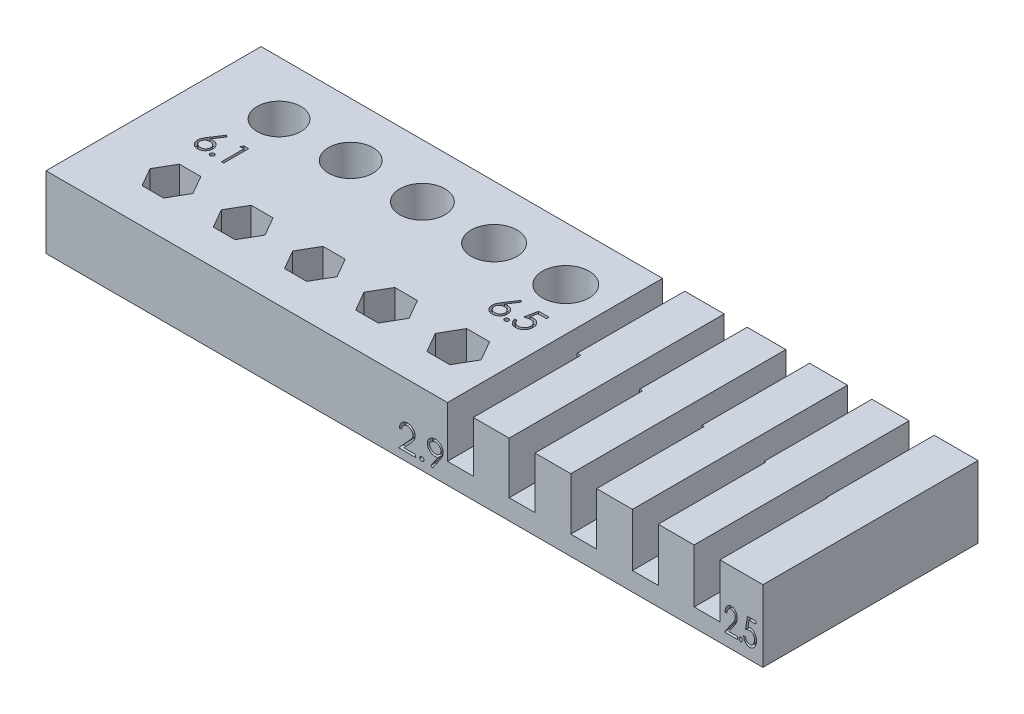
from build123d import *

# Parameters (mm, degrees)
CROQUIS1_W              = 100
CROQUIS1_H              = 30
SALIENTE_EXTRUIR1_DEPTH = 10
CROQUIS2_R              = 3.05
CROQUIS2_R_2            = 3.1
CROQUIS2_R_3            = 3.15
CROQUIS2_R_4            = 3.2
CROQUIS2_R_5            = 3.25
CORTAR_EXTRUIR1_DEPTH   = 10
CROQUIS3_W              = 3.6
CROQUIS3_H              = 7.1
CROQUIS3_H_2            = 7.2
CROQUIS3_H_3            = 7.3
CROQUIS3_H_4            = 7.4
CROQUIS3_H_5            = 7.5
CORTAR_EXTRUIR2_DEPTH   = 15
CROQUIS6_W              = 3.1
CROQUIS6_H              = 7.6
CROQUIS6_W_2            = 3.2
CROQUIS6_W_3            = 3.3
CROQUIS6_W_4            = 3.4
CROQUIS6_W_5            = 3.5
CORTAR_EXTRUIR4_DEPTH   = 15
CORTAR_EXTRUIR5_DEPTH   = 0.7
CORTAR_EXTRUIR6_DEPTH   = 0.7
CORTAR_EXTRUIR7_DEPTH   = 0.7


with BuildPart() as part:
    # Croquis1 → Saliente-Extruir1 (new body)
    with BuildSketch(Plane(origin=(0, 0, 0), x_dir=(1, 0, 0), z_dir=(0, 1, 0))):
        Rectangle(CROQUIS1_W, CROQUIS1_H)
    extrude(amount=SALIENTE_EXTRUIR1_DEPTH)

    # Croquis2 → Cortar-Extruir1 (cut)
    with BuildSketch(Plane(origin=(0, 10, 0), x_dir=(1, 0, 0), z_dir=(0, 1, 0))):
        with Locations(Location((-40, 7.5, 0), (0, 0, 270))):
            Circle(CROQUIS2_R)
        with Locations(Location((-30, 7.5, 0), (0, 0, 270))):
            Circle(CROQUIS2_R_2)
        with Locations(Location((-20, 7.5, 0), (0, 0, 270))):
            Circle(CROQUIS2_R_3)
        with Locations(Location((-10, 7.5, 0), (0, 0, 270))):
            Circle(CROQUIS2_R_4)
        with Locations(Location((0, 7.5, 0), (0, 0, 270))):
            Circle(CROQUIS2_R_5)
        Polygon((-37, -7.5), (-38.5, -4.901923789), (-41.5, -4.901923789), (-43, -7.5), (-41.5, -10.098076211), (-38.5, -10.098076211), align=None)
        Polygon((-26.95, -7.5), (-28.475, -4.858622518), (-31.525, -4.858622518), (-33.05, -7.5), (-31.525, -10.141377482), (-28.475, -10.141377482), align=None)
        Polygon((-16.9, -7.5), (-18.45, -4.815321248), (-21.55, -4.815321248), (-23.1, -7.5), (-21.55, -10.184678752), (-18.45, -10.184678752), align=None)
        Polygon((-6.85, -7.5), (-8.425, -4.772019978), (-11.575, -4.772019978), (-13.15, -7.5), (-11.575, -10.227980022), (-8.425, -10.227980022), align=None)
        Polygon((3.2, -7.5), (1.6, -4.728718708), (-1.6, -4.728718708), (-3.2, -7.5), (-1.6, -10.271281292), (1.6, -10.271281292), align=None)
    extrude(amount=-CORTAR_EXTRUIR1_DEPTH, mode=Mode.SUBTRACT)

    # Croquis3 → Cortar-Extruir2 (cut)
    with BuildSketch(Plane.XY.offset(15)):
        with Locations((7.8, 6.45)):
            Rectangle(CROQUIS3_W, CROQUIS3_H)
        with Locations((16.4, 6.4)):
            Rectangle(CROQUIS3_W, CROQUIS3_H_2)
        with Locations((25, 6.35)):
            Rectangle(CROQUIS3_W, CROQUIS3_H_3)
        with Locations((33.6, 6.3)):
            Rectangle(CROQUIS3_W, CROQUIS3_H_4)
        with Locations((42.2, 6.25)):
            Rectangle(CROQUIS3_W, CROQUIS3_H_5)
    extrude(amount=-CORTAR_EXTRUIR2_DEPTH, mode=Mode.SUBTRACT)

    # Croquis6 → Cortar-Extruir4 (cut)
    with BuildSketch(Plane(origin=(0, 0, -15), x_dir=(-1, 0, 0), z_dir=(0, 0, -1))):
        with Locations((-7.55, 6.2)):
            Rectangle(CROQUIS6_W, CROQUIS6_H)
        with Locations((-16.2, 6.2)):
            Rectangle(CROQUIS6_W_2, CROQUIS6_H)
        with Locations((-24.85, 6.2)):
            Rectangle(CROQUIS6_W_3, CROQUIS6_H)
        with Locations((-33.5, 6.2)):
            Rectangle(CROQUIS6_W_4, CROQUIS6_H)
        with Locations((-42.15, 6.2)):
            Rectangle(CROQUIS6_W_5, CROQUIS6_H)
    extrude(amount=-CORTAR_EXTRUIR4_DEPTH, mode=Mode.SUBTRACT)

    # Croquis7 → Cortar-Extruir5 (cut)
    # profile 1 of 6: a face of its own
    with BuildSketch(Plane.XY.offset(15)):
        with BuildLine():
            Line((-0.386113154, 3.562136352), (-0.700215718, 3.562136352))
            add(Edge.make_bspline(
                [(-0.700215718, 3.562136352), (-0.698168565, 3.60380724), (-0.694148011, 3.685647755), (-0.675319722, 3.804971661), (-0.648378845, 3.91902646), (-0.610287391, 4.026896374), (-0.562981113, 4.129535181), (-0.506251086, 4.226535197), (-0.439057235, 4.317526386), (-0.362850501, 4.401665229), (-0.280081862, 4.4788528), (-0.190775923, 4.545508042), (-0.096930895, 4.601825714), (0.001168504, 4.648906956), (0.104629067, 4.684246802), (0.212511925, 4.710468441), (0.325291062, 4.726244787), (0.402131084, 4.727940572), (0.441210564, 4.728803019)],
                knots=[0, 0, 0, 0, 1.10065271, 2.161652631, 3.183658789, 4.190468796, 5.17591951, 6.163126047, 7.15150782, 8.156236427, 9.156009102, 10.134482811, 11.092018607, 12.041330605, 13.001268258, 13.972401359, 14.968799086, 16, 16, 16, 16], degree=3))
            add(Edge.make_bspline(
                [(0.441210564, 4.728803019), (0.479588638, 4.727904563), (0.555000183, 4.726139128), (0.665062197, 4.710978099), (0.769839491, 4.687232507), (0.869127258, 4.653917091), (0.962133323, 4.609132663), (1.049556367, 4.555335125), (1.132437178, 4.493115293), (1.207043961, 4.41986148), (1.275552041, 4.341659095), (1.334654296, 4.258171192), (1.385267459, 4.171941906), (1.427455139, 4.082313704), (1.458511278, 3.988442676), (1.482089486, 3.891695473), (1.4954169, 3.791070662), (1.497462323, 3.722964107), (1.49850223, 3.688338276)],
                knots=[0, 0, 0, 0, 1.111607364, 2.184268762, 3.212621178, 4.221274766, 5.211760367, 6.196651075, 7.1921475, 8.207485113, 9.220403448, 10.201281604, 11.166441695, 12.114753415, 13.065576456, 14.026450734, 14.996634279, 16, 16, 16, 16], degree=3))
            add(Edge.make_bspline(
                [(1.49850223, 3.688338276), (1.496808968, 3.639590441), (1.493452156, 3.542950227), (1.46473778, 3.400935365), (1.419891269, 3.263341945), (1.365893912, 3.152604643), (1.311421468, 3.06337115), (1.26233396, 2.989902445), (1.204869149, 2.910796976), (1.138190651, 2.826319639), (1.063677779, 2.735808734), (0.980655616, 2.639318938), (0.888532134, 2.537847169), (0.823873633, 2.468541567), (0.790369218, 2.432629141)],
                knots=[0, 0, 0, 0, 1.184426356, 2.348067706, 3.509069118, 4.696110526, 5.333549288, 6.050745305, 6.844228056, 7.710549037, 8.667450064, 9.695053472, 10.805634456, 12, 12, 12, 12], degree=3))
            Line((0.790369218, 2.432629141), (-0.085331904, 1.498033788))
            Line((-0.085331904, 1.498033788), (1.543374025, 1.498033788))
            Line((1.543374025, 1.498033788), (1.543374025, 1.139059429))
            Line((1.543374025, 1.139059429), (-0.834831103, 1.139059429))
            Line((-0.834831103, 1.139059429), (0.522540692, 2.587577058))
            add(Edge.make_bspline(
                [(0.522540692, 2.587577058), (0.555588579, 2.622075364), (0.619066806, 2.688339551), (0.708849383, 2.785082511), (0.789488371, 2.874832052), (0.861505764, 2.9574186), (0.923339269, 3.034050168), (0.978211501, 3.102244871), (1.022177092, 3.164999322), (1.069892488, 3.237739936), (1.116106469, 3.326552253), (1.155818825, 3.435085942), (1.180033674, 3.546813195), (1.182938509, 3.622315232), (1.184399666, 3.660293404)],
                knots=[0, 0, 0, 0, 1.329631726, 2.553950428, 3.673215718, 4.687767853, 5.603093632, 6.413772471, 7.123043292, 7.734684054, 8.834405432, 9.900288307, 10.943827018, 12, 12, 12, 12], degree=3))
            add(Edge.make_bspline(
                [(1.184399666, 3.660293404), (1.183763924, 3.684174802), (1.182510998, 3.731240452), (1.171453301, 3.800246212), (1.154742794, 3.866811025), (1.130797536, 3.931139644), (1.099190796, 3.992585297), (1.060717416, 4.051222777), (1.016327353, 4.107911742), (0.964976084, 4.16106504), (0.908564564, 4.209746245), (0.848970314, 4.252870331), (0.78592021, 4.288909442), (0.719680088, 4.318452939), (0.650434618, 4.34162832), (0.578049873, 4.357686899), (0.502725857, 4.367769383), (0.451292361, 4.369133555), (0.425084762, 4.36982866)],
                knots=[0, 0, 0, 0, 0.991446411, 1.95395049, 2.89581595, 3.838931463, 4.798493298, 5.75982156, 6.748411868, 7.785213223, 8.824556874, 9.840280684, 10.836137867, 11.835679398, 12.848801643, 13.863922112, 14.911575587, 16, 16, 16, 16], degree=3))
            add(Edge.make_bspline(
                [(0.425084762, 4.36982866), (0.39771393, 4.369113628), (0.343962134, 4.367709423), (0.265043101, 4.357886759), (0.189757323, 4.340940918), (0.11791542, 4.317764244), (0.049395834, 4.288305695), (-0.01546821, 4.25161395), (-0.076531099, 4.207830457), (-0.133907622, 4.158189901), (-0.186771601, 4.1029223), (-0.233218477, 4.041312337), (-0.273802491, 3.974484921), (-0.309211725, 3.902620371), (-0.337967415, 3.825066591), (-0.359940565, 3.742098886), (-0.377327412, 3.654077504), (-0.383135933, 3.593292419), (-0.386113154, 3.562136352)],
                knots=[0, 0, 0, 0, 1.031018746, 2.02475058, 2.990194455, 3.934040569, 4.864654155, 5.795059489, 6.735614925, 7.690564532, 8.649604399, 9.611025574, 10.590972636, 11.591080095, 12.624614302, 13.701020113, 14.821632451, 16, 16, 16, 16], degree=3))
        make_face()
    # profile 2 of 6: a face of its own
    with BuildSketch(Plane.XY.offset(15)):
        with BuildLine():
            add(Edge.make_bspline(
                [(2.418374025, 1.677520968), (2.437864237, 1.676362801), (2.47607252, 1.674092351), (2.531311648, 1.658515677), (2.581306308, 1.630857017), (2.625838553, 1.593994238), (2.662545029, 1.549298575), (2.691189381, 1.499702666), (2.706630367, 1.444001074), (2.708884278, 1.405571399), (2.710040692, 1.385854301)],
                knots=[0, 0, 0, 0, 1.020151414, 1.999887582, 2.974338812, 3.990962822, 5.007586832, 5.987933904, 6.967670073, 8, 8, 8, 8], degree=3))
            add(Edge.make_bspline(
                [(2.710040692, 1.385854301), (2.708845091, 1.366610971), (2.706487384, 1.328663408), (2.691224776, 1.273381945), (2.662326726, 1.223755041), (2.626091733, 1.178452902), (2.581295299, 1.141512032), (2.531193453, 1.114088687), (2.476202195, 1.097396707), (2.437885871, 1.09527041), (2.418374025, 1.094187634)],
                knots=[0, 0, 0, 0, 1.009421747, 1.99056486, 2.972319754, 3.999869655, 5.017953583, 5.993804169, 6.978383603, 8, 8, 8, 8], degree=3))
            add(Edge.make_bspline(
                [(2.418374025, 1.094187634), (2.39884812, 1.095231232), (2.360728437, 1.097268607), (2.305942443, 1.114431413), (2.255535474, 1.141254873), (2.210747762, 1.178521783), (2.174209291, 1.223521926), (2.146583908, 1.273723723), (2.129993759, 1.32850516), (2.127811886, 1.366579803), (2.126707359, 1.385854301)],
                knots=[0, 0, 0, 0, 1.022052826, 1.995314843, 2.982371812, 4.00089066, 5.028879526, 6.005146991, 6.990147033, 8, 8, 8, 8], degree=3))
            add(Edge.make_bspline(
                [(2.126707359, 1.385854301), (2.127769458, 1.405603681), (2.129843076, 1.444161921), (2.146618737, 1.499361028), (2.173994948, 1.549529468), (2.211000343, 1.593926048), (2.255524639, 1.63111335), (2.305820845, 1.658178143), (2.360860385, 1.674218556), (2.398870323, 1.676401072), (2.418374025, 1.677520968)],
                knots=[0, 0, 0, 0, 1.032775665, 2.016367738, 2.991239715, 4.008302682, 5.025365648, 6.011011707, 6.979408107, 8, 8, 8, 8], degree=3))
        make_face()
    # profile 3 of 6: a face of its own
    with BuildSketch(Plane.XY.offset(15)):
        with BuildLine():
            Line((3.921579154, 1.04931584), (3.670577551, 1.223895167))
            Line((3.670577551, 1.223895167), (4.643734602, 2.646471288))
            add(Edge.make_bspline(
                [(4.643734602, 2.646471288), (4.581643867, 2.638878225), (4.459383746, 2.62392706), (4.336246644, 2.621180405), (4.27564566, 2.61982866)],
                knots=[0, 0, 0, 0, 1.015715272, 2, 2, 2, 2], degree=3))
            add(Edge.make_bspline(
                [(4.27564566, 2.61982866), (4.238903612, 2.620769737), (4.166782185, 2.622616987), (4.060750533, 2.637258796), (3.958864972, 2.659808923), (3.861395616, 2.693457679), (3.767976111, 2.735275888), (3.678810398, 2.787132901), (3.594018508, 2.848139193), (3.514511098, 2.917972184), (3.442199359, 2.994650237), (3.377776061, 3.07580588), (3.324234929, 3.16238185), (3.279758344, 3.25261207), (3.24602789, 3.347793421), (3.221465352, 3.446842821), (3.206342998, 3.550454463), (3.204543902, 3.620979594), (3.203630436, 3.656787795)],
                knots=[0, 0, 0, 0, 1.060718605, 2.082097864, 3.085795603, 4.069760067, 5.054557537, 6.03741023, 7.043284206, 8.066802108, 9.088538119, 10.083643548, 11.053783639, 12.022749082, 12.983451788, 13.964007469, 14.966251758, 16, 16, 16, 16], degree=3))
            add(Edge.make_bspline(
                [(3.203630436, 3.656787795), (3.20536487, 3.705756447), (3.208769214, 3.801871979), (3.236167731, 3.942305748), (3.28122807, 4.075092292), (3.344056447, 4.199882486), (3.423191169, 4.314881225), (3.518299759, 4.418489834), (3.628803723, 4.509234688), (3.752185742, 4.587238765), (3.885538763, 4.649973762), (4.025207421, 4.696213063), (4.170121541, 4.723411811), (4.268289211, 4.726997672), (4.317712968, 4.728803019)],
                knots=[0, 0, 0, 0, 1.022988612, 2.007919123, 2.978103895, 3.94594894, 4.918897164, 5.887013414, 6.875921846, 7.89917871, 8.930658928, 9.948724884, 10.967259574, 12, 12, 12, 12], degree=3))
            add(Edge.make_bspline(
                [(4.317712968, 4.728803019), (4.366201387, 4.726972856), (4.462009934, 4.723356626), (4.602898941, 4.696872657), (4.737839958, 4.652235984), (4.866084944, 4.590551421), (4.984824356, 4.513230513), (5.091600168, 4.421095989), (5.183975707, 4.314090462), (5.261799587, 4.194801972), (5.324269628, 4.066634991), (5.369341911, 3.932851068), (5.39708755, 3.794412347), (5.400583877, 3.700617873), (5.402348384, 3.653282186)],
                knots=[0, 0, 0, 0, 1.026385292, 2.028040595, 3.023318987, 4.028184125, 5.03290303, 6.015178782, 7.004435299, 8.016004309, 9.023023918, 10.015172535, 10.998308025, 12, 12, 12, 12], degree=3))
            add(Edge.make_bspline(
                [(5.402348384, 3.653282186), (5.401169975, 3.616538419), (5.398779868, 3.542012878), (5.382043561, 3.428782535), (5.353623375, 3.313331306), (5.321371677, 3.21560971), (5.290239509, 3.13490126), (5.260938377, 3.07114968), (5.228426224, 3.004048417), (5.190507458, 2.934301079), (5.149745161, 2.861018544), (5.103685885, 2.784935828), (5.053380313, 2.705950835), (5.017550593, 2.652703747), (4.999203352, 2.625437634)],
                knots=[0, 0, 0, 0, 1.179839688, 2.393009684, 3.667231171, 4.993948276, 5.694988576, 6.444077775, 7.246288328, 8.089075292, 8.993003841, 9.939041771, 10.944649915, 12, 12, 12, 12], degree=3))
            Line((4.999203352, 2.625437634), (3.921579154, 1.04931584))
        make_face()
        with BuildLine():
            add(Edge.make_bspline(
                [(4.333838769, 2.978803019), (4.361672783, 2.979563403), (4.415856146, 2.981043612), (4.495233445, 2.990052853), (4.570157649, 3.00602684), (4.640828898, 3.028946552), (4.7079558, 3.056603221), (4.770472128, 3.091815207), (4.828430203, 3.133831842), (4.88221813, 3.181041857), (4.92998213, 3.233492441), (4.972525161, 3.288389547), (5.008685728, 3.345974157), (5.037249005, 3.40696742), (5.060733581, 3.469884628), (5.076951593, 3.535738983), (5.085935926, 3.604187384), (5.087467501, 3.650686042), (5.08824582, 3.67431584)],
                knots=[0, 0, 0, 0, 1.163407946, 2.26475976, 3.333800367, 4.359385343, 5.366239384, 6.363380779, 7.350133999, 8.353570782, 9.349036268, 10.310270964, 11.253520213, 12.184142, 13.120487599, 14.056272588, 15.012232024, 16, 16, 16, 16], degree=3))
            add(Edge.make_bspline(
                [(5.08824582, 3.67431584), (5.087576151, 3.697955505), (5.086256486, 3.744540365), (5.075669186, 3.813090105), (5.057043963, 3.878783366), (5.032053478, 3.941979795), (4.99913324, 4.002160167), (4.959629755, 4.060080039), (4.912697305, 4.115372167), (4.858694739, 4.16673615), (4.800460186, 4.21408405), (4.738399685, 4.255870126), (4.673024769, 4.290891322), (4.60473428, 4.319790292), (4.533385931, 4.342342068), (4.459021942, 4.358559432), (4.381266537, 4.367531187), (4.328485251, 4.369053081), (4.301587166, 4.36982866)],
                knots=[0, 0, 0, 0, 0.972161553, 1.915763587, 2.844109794, 3.775983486, 4.705125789, 5.659731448, 6.655561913, 7.682237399, 8.721216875, 9.739758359, 10.754845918, 11.767244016, 12.7857855, 13.828538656, 14.893392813, 16, 16, 16, 16], degree=3))
            add(Edge.make_bspline(
                [(4.301587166, 4.36982866), (4.274923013, 4.369051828), (4.222608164, 4.367527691), (4.145544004, 4.358576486), (4.071682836, 4.342233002), (4.000541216, 4.319800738), (3.932252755, 4.290889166), (3.866880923, 4.255868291), (3.804805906, 4.214093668), (3.746627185, 4.166698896), (3.692529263, 4.11561125), (3.646403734, 4.059837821), (3.606809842, 4.002190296), (3.573934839, 3.941971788), (3.548932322, 3.878785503), (3.53031032, 3.813089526), (3.519722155, 3.744540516), (3.518402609, 3.697955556), (3.517733, 3.67431584)],
                knots=[0, 0, 0, 0, 1.099389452, 2.15699305, 3.192601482, 4.213358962, 5.227959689, 6.245255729, 7.266013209, 8.307253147, 9.336162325, 10.327954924, 11.284637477, 12.215801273, 13.149702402, 14.080068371, 15.025723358, 16, 16, 16, 16], degree=3))
            add(Edge.make_bspline(
                [(3.517733, 3.67431584), (3.518338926, 3.650667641), (3.519533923, 3.604029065), (3.531061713, 3.535502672), (3.550339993, 3.469814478), (3.576159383, 3.406325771), (3.610160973, 3.345653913), (3.651884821, 3.288086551), (3.700790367, 3.232971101), (3.756223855, 3.181163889), (3.816892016, 3.133611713), (3.881688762, 3.092081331), (3.949498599, 3.057008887), (4.02056023, 3.028867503), (4.09434703, 3.006255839), (4.171522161, 2.990082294), (4.251830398, 2.981130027), (4.30624038, 2.97958613), (4.333838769, 2.978803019)],
                knots=[0, 0, 0, 0, 0.952633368, 1.87876736, 2.791047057, 3.707742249, 4.635551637, 5.587206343, 6.568248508, 7.601284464, 8.641511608, 9.671105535, 10.699146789, 11.713763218, 12.747829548, 13.806491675, 14.887386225, 16, 16, 16, 16], degree=3))
        make_face(mode=Mode.SUBTRACT)
    # profile 4 of 6: a face of its own
    with BuildSketch(Plane.XY.offset(15)):
        with BuildLine():
            Line((44.975656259, 4.024839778), (44.70642549, 4.024839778))
            add(Edge.make_bspline(
                [(44.70642549, 4.024839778), (44.707955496, 4.066477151), (44.710954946, 4.148103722), (44.725074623, 4.267398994), (44.7470743, 4.380922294), (44.775282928, 4.488986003), (44.812187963, 4.591363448), (44.85599721, 4.688277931), (44.908408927, 4.779002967), (44.966849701, 4.863790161), (45.03149787, 4.940271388), (45.100315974, 5.007526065), (45.173124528, 5.063983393), (45.249199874, 5.111076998), (45.329792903, 5.146775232), (45.413694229, 5.172993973), (45.50135974, 5.188925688), (45.56102709, 5.19063891), (45.591241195, 5.191506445)],
                knots=[0, 0, 0, 0, 1.230938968, 2.413152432, 3.545534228, 4.646194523, 5.710096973, 6.757825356, 7.784954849, 8.802285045, 9.797142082, 10.739805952, 11.640550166, 12.51471503, 13.377261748, 14.237953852, 15.107742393, 16, 16, 16, 16], degree=3))
            add(Edge.make_bspline(
                [(45.591241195, 5.191506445), (45.621217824, 5.190608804), (45.67991243, 5.188851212), (45.765660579, 5.173693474), (45.846736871, 5.148916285), (45.92415809, 5.115308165), (45.996338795, 5.070593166), (46.064641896, 5.01678141), (46.127459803, 4.952369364), (46.186088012, 4.879776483), (46.238345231, 4.800492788), (46.285517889, 4.717511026), (46.323519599, 4.629978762), (46.356427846, 4.539601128), (46.380302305, 4.445263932), (46.39914672, 4.347985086), (46.409530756, 4.246855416), (46.410872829, 4.178173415), (46.411553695, 4.143329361)],
                knots=[0, 0, 0, 0, 0.970791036, 1.900820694, 2.811155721, 3.713104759, 4.62746283, 5.554713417, 6.523967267, 7.536371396, 8.573953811, 9.597848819, 10.625126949, 11.662294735, 12.711119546, 13.774578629, 14.87098949, 16, 16, 16, 16], degree=3))
            add(Edge.make_bspline(
                [(46.411553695, 4.143329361), (46.410082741, 4.094429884), (46.407171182, 3.997639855), (46.387693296, 3.85459046), (46.352649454, 3.71678785), (46.313240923, 3.604419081), (46.272829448, 3.513947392), (46.236049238, 3.440195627), (46.193304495, 3.360446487), (46.144233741, 3.274712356), (46.087795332, 3.184033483), (46.026108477, 3.086719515), (45.957365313, 2.98419634), (45.909151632, 2.913981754), (45.884310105, 2.877804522)],
                knots=[0, 0, 0, 0, 1.261295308, 2.496566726, 3.714418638, 4.923181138, 5.562775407, 6.269082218, 7.048469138, 7.896342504, 8.816478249, 9.803085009, 10.868065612, 12, 12, 12, 12], degree=3))
            Line((45.884310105, 2.877804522), (45.235071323, 1.960737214))
            Line((45.235071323, 1.960737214), (46.45642549, 1.960737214))
            Line((46.45642549, 1.960737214), (46.45642549, 1.601762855))
            Line((46.45642549, 1.601762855), (44.6166819, 1.601762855))
            Line((44.6166819, 1.601762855), (45.642423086, 3.050280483))
            add(Edge.make_bspline(
                [(45.642423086, 3.050280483), (45.667249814, 3.084830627), (45.71508075, 3.1513946), (45.783155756, 3.247950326), (45.844219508, 3.337668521), (45.898453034, 3.420649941), (45.945859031, 3.496648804), (45.987067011, 3.565548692), (46.020761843, 3.627775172), (46.056300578, 3.701459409), (46.091670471, 3.790348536), (46.120970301, 3.89877225), (46.139366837, 4.009953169), (46.141331, 4.08506464), (46.142322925, 4.122996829)],
                knots=[0, 0, 0, 0, 1.270435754, 2.447609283, 3.527690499, 4.510998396, 5.407568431, 6.202286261, 6.907966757, 7.519751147, 8.644626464, 9.758603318, 10.86806791, 12, 12, 12, 12], degree=3))
            add(Edge.make_bspline(
                [(46.142322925, 4.122996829), (46.141751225, 4.146855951), (46.140627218, 4.193764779), (46.132748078, 4.262684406), (46.120085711, 4.329008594), (46.102667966, 4.393154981), (46.079618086, 4.454633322), (46.051142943, 4.513348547), (46.018137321, 4.569815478), (45.98006396, 4.623048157), (45.938265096, 4.671793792), (45.894223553, 4.715233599), (45.846901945, 4.750785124), (45.798079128, 4.780900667), (45.746597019, 4.804390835), (45.692456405, 4.820114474), (45.636273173, 4.830507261), (45.598065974, 4.831849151), (45.578621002, 4.832532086)],
                knots=[0, 0, 0, 0, 1.139723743, 2.240782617, 3.309378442, 4.363054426, 5.412403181, 6.441115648, 7.477073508, 8.533585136, 9.562963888, 10.542068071, 11.482200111, 12.384095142, 13.278564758, 14.175817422, 15.071610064, 16, 16, 16, 16], degree=3))
            add(Edge.make_bspline(
                [(45.578621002, 4.832532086), (45.558250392, 4.831822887), (45.518203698, 4.830428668), (45.459289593, 4.820432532), (45.403092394, 4.80351043), (45.349447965, 4.780201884), (45.298405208, 4.750592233), (45.250438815, 4.713511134), (45.204929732, 4.669969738), (45.162341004, 4.620091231), (45.122804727, 4.564808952), (45.088624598, 4.503204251), (45.058346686, 4.436691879), (45.033481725, 4.364420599), (45.01132057, 4.287348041), (44.99511614, 4.204484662), (44.981990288, 4.116550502), (44.977806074, 4.055967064), (44.975656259, 4.024839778)],
                knots=[0, 0, 0, 0, 0.874902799, 1.719976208, 2.558523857, 3.390373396, 4.227236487, 5.086679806, 5.988529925, 6.928309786, 7.90051169, 8.902983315, 9.949917, 11.035886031, 12.183280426, 13.392230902, 14.66014911, 16, 16, 16, 16], degree=3))
        make_face()
    # profile 5 of 6: a face of its own
    with BuildSketch(Plane.XY.offset(15)):
        with BuildLine():
            add(Edge.make_bspline(
                [(46.900656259, 2.140224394), (46.915742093, 2.139069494), (46.945555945, 2.136787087), (46.988527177, 2.120609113), (47.026967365, 2.092829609), (47.060854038, 2.05557146), (47.089074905, 2.011138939), (47.110832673, 1.96141713), (47.122562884, 1.906353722), (47.124180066, 1.868240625), (47.125015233, 1.848557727)],
                knots=[0, 0, 0, 0, 0.888235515, 1.755403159, 2.664739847, 3.658771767, 4.705496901, 5.754303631, 6.840246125, 8, 8, 8, 8], degree=3))
            add(Edge.make_bspline(
                [(47.125015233, 1.848557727), (47.12414856, 1.829346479), (47.122450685, 1.791710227), (47.110867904, 1.737080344), (47.088872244, 1.687270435), (47.061080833, 1.642349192), (47.026970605, 1.604931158), (46.988374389, 1.577390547), (46.945716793, 1.560130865), (46.915768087, 1.557977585), (46.900656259, 1.55689106)],
                knots=[0, 0, 0, 0, 1.133833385, 2.221263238, 3.271506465, 4.33130329, 5.326696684, 6.237278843, 7.110547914, 8, 8, 8, 8], degree=3))
            add(Edge.make_bspline(
                [(46.900656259, 1.55689106), (46.885536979, 1.557967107), (46.855573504, 1.560099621), (46.812846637, 1.577588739), (46.773674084, 1.604661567), (46.739611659, 1.642408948), (46.711556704, 1.687088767), (46.690647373, 1.737265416), (46.678802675, 1.791684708), (46.677143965, 1.829337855), (46.676297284, 1.848557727)],
                knots=[0, 0, 0, 0, 0.888790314, 1.761409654, 2.682617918, 3.677270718, 4.73627903, 5.78038943, 6.867010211, 8, 8, 8, 8], degree=3))
            add(Edge.make_bspline(
                [(46.676297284, 1.848557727), (46.677111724, 1.868249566), (46.678688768, 1.906379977), (46.69068265, 1.961232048), (46.711357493, 2.011319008), (46.739837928, 2.055512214), (46.773677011, 2.093099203), (46.812692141, 2.120414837), (46.855734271, 2.136818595), (46.885562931, 2.13908008), (46.900656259, 2.140224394)],
                knots=[0, 0, 0, 0, 1.158892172, 2.244027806, 3.286711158, 4.33265857, 5.32595192, 6.245901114, 7.112424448, 8, 8, 8, 8], degree=3))
        make_face()
    # profile 6 of 6: a face of its own
    with BuildSketch(Plane.XY.offset(15)):
        with BuildLine():
            Line((49.005143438, 5.101762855), (49.005143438, 4.742788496))
            Line((49.005143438, 4.742788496), (48.05652565, 4.742788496))
            Line((48.05652565, 4.742788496), (47.914899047, 3.819411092))
            add(Edge.make_bspline(
                [(47.914899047, 3.819411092), (47.943725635, 3.830162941), (47.999338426, 3.850905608), (48.082091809, 3.87329515), (48.160715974, 3.887764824), (48.211883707, 3.889420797), (48.236713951, 3.890224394)],
                knots=[0, 0, 0, 0, 1.113577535, 2.148334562, 3.101439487, 4, 4, 4, 4], degree=3))
            add(Edge.make_bspline(
                [(48.236713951, 3.890224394), (48.26716849, 3.889387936), (48.327082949, 3.887742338), (48.414828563, 3.871508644), (48.498681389, 3.846425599), (48.578369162, 3.811211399), (48.653687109, 3.765646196), (48.724523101, 3.709619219), (48.792343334, 3.64437918), (48.853971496, 3.568469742), (48.91043583, 3.48576399), (48.959921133, 3.396559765), (49.001765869, 3.301969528), (49.036665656, 3.201750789), (49.06203767, 3.095455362), (49.080811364, 2.983725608), (49.093365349, 2.866403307), (49.094372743, 2.786224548), (49.094887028, 2.745292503)],
                knots=[0, 0, 0, 0, 0.915452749, 1.801007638, 2.675239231, 3.544138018, 4.414827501, 5.316484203, 6.256349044, 7.24041834, 8.25264956, 9.266198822, 10.305020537, 11.361306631, 12.454513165, 13.588568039, 14.768940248, 16, 16, 16, 16], degree=3))
            add(Edge.make_bspline(
                [(49.094887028, 2.745292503), (49.093518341, 2.688647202), (49.090824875, 2.577173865), (49.066198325, 2.413904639), (49.02688727, 2.257670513), (48.972799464, 2.11021129), (48.905546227, 1.974402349), (48.82594774, 1.854259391), (48.73580515, 1.749881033), (48.649709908, 1.678593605), (48.577568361, 1.628805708), (48.520377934, 1.598587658), (48.461957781, 1.571220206), (48.401039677, 1.549865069), (48.338273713, 1.532724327), (48.27325902, 1.521151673), (48.206313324, 1.512829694), (48.160785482, 1.512290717), (48.137855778, 1.512019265)],
                knots=[0, 0, 0, 0, 1.560107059, 3.070163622, 4.538401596, 5.993174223, 7.390017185, 8.704628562, 9.955064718, 11.175437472, 11.773810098, 12.367450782, 12.955334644, 13.550126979, 14.143767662, 14.746284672, 15.368577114, 16, 16, 16, 16], degree=3))
            add(Edge.make_bspline(
                [(48.137855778, 1.512019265), (48.110447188, 1.512714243), (48.05646138, 1.514083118), (47.977595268, 1.528307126), (47.90161368, 1.548961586), (47.829260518, 1.579511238), (47.759751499, 1.618378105), (47.69412301, 1.666437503), (47.630965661, 1.722105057), (47.572691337, 1.786816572), (47.518224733, 1.857676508), (47.469846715, 1.934638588), (47.426751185, 2.016362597), (47.389939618, 2.103279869), (47.358107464, 2.195045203), (47.332248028, 2.291789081), (47.312582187, 2.393746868), (47.304256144, 2.463612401), (47.300015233, 2.499198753)],
                knots=[0, 0, 0, 0, 0.923275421, 1.818545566, 2.694317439, 3.573945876, 4.459590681, 5.373909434, 6.311768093, 7.29356341, 8.305513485, 9.322178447, 10.355055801, 11.417807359, 12.501966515, 13.627940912, 14.791780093, 16, 16, 16, 16], degree=3))
            Line((47.300015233, 2.499198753), (47.569246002, 2.499198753))
            add(Edge.make_bspline(
                [(47.569246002, 2.499198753), (47.574982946, 2.465890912), (47.585948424, 2.402226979), (47.610801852, 2.312404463), (47.640567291, 2.232138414), (47.676425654, 2.160812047), (47.719348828, 2.098489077), (47.767465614, 2.042218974), (47.822176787, 1.992275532), (47.883223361, 1.949916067), (47.947557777, 1.914550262), (48.015275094, 1.890136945), (48.084013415, 1.873646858), (48.130751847, 1.871874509), (48.153981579, 1.870993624)],
                knots=[0, 0, 0, 0, 1.295040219, 2.475313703, 3.5669374, 4.572676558, 5.526934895, 6.460829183, 7.40583148, 8.357815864, 9.30383694, 10.210915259, 11.110796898, 12, 12, 12, 12], degree=3))
            add(Edge.make_bspline(
                [(48.153981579, 1.870993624), (48.176707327, 1.871822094), (48.22154046, 1.873456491), (48.287216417, 1.88584552), (48.350526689, 1.905380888), (48.410755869, 1.934177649), (48.469926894, 1.968906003), (48.524802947, 2.014077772), (48.578795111, 2.065202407), (48.628439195, 2.124678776), (48.674521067, 2.18952253), (48.715620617, 2.258862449), (48.748836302, 2.333034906), (48.777322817, 2.410430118), (48.798927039, 2.491909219), (48.81404206, 2.577291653), (48.824526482, 2.666507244), (48.825274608, 2.727499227), (48.825656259, 2.758613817)],
                knots=[0, 0, 0, 0, 0.883627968, 1.743212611, 2.591519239, 3.453888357, 4.334892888, 5.253609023, 6.211746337, 7.224577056, 8.261445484, 9.30467269, 10.354377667, 11.418591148, 12.510297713, 13.628489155, 14.790192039, 16, 16, 16, 16], degree=3))
            add(Edge.make_bspline(
                [(48.825656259, 2.758613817), (48.82514446, 2.786680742), (48.824144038, 2.841543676), (48.815556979, 2.92171097), (48.801689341, 2.997705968), (48.782001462, 3.06974338), (48.756652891, 3.137662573), (48.726718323, 3.202157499), (48.689958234, 3.261911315), (48.647824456, 3.317024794), (48.602044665, 3.367761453), (48.55129925, 3.411430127), (48.496461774, 3.448106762), (48.438587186, 3.479435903), (48.376075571, 3.502247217), (48.310408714, 3.519431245), (48.240740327, 3.529120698), (48.193039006, 3.530530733), (48.168705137, 3.531250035)],
                knots=[0, 0, 0, 0, 1.180781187, 2.308094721, 3.388266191, 4.428481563, 5.445995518, 6.435805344, 7.415746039, 8.391334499, 9.351887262, 10.286308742, 11.200059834, 12.123916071, 13.048190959, 13.992752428, 14.976043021, 16, 16, 16, 16], degree=3))
            add(Edge.make_bspline(
                [(48.168705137, 3.531250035), (48.14741156, 3.530685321), (48.103733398, 3.52952696), (48.036726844, 3.52051455), (47.966691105, 3.50652611), (47.8934743, 3.486572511), (47.816978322, 3.461209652), (47.737039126, 3.430147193), (47.653653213, 3.393881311), (47.597868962, 3.36604546), (47.569246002, 3.351762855)],
                knots=[0, 0, 0, 0, 0.80946005, 1.660394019, 2.566651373, 3.523765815, 4.543866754, 5.629776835, 6.783835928, 8, 8, 8, 8], degree=3))
            Line((47.569246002, 3.351762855), (47.838476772, 5.101762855))
            Line((47.838476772, 5.101762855), (49.005143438, 5.101762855))
        make_face()
    extrude(amount=-CORTAR_EXTRUIR5_DEPTH, mode=Mode.SUBTRACT)

    # Croquis8 → Cortar-Extruir6 (cut)
    with BuildSketch(Plane(origin=(0, 0, -15), x_dir=(-1, 0, 0), z_dir=(0, 0, -1))):
        with BuildLine():
            Line((-4.393925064, 4.058810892), (-4.663155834, 4.058810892))
            add(Edge.make_bspline(
                [(-4.663155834, 4.058810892), (-4.656305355, 4.093953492), (-4.642978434, 4.162319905), (-4.616858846, 4.261169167), (-4.586085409, 4.353632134), (-4.551106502, 4.440127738), (-4.511858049, 4.520334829), (-4.468200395, 4.594528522), (-4.420133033, 4.66255109), (-4.367139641, 4.72364759), (-4.311453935, 4.778523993), (-4.252191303, 4.825568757), (-4.190988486, 4.865784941), (-4.12758991, 4.899298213), (-4.061095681, 4.924544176), (-3.99223404, 4.942634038), (-3.920843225, 4.954510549), (-3.872338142, 4.955662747), (-3.847751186, 4.956246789)],
                knots=[0, 0, 0, 0, 1.298810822, 2.526706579, 3.706552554, 4.832417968, 5.909420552, 6.943403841, 7.952790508, 8.926794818, 9.874230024, 10.785337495, 11.667291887, 12.528247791, 13.381780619, 14.241524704, 15.108638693, 16, 16, 16, 16], degree=3))
            add(Edge.make_bspline(
                [(-3.847751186, 4.956246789), (-3.812095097, 4.954823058), (-3.740909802, 4.951980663), (-3.636604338, 4.927166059), (-3.536214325, 4.88711716), (-3.440717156, 4.832511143), (-3.3519123, 4.764771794), (-3.272580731, 4.684996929), (-3.205061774, 4.593474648), (-3.148594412, 4.492787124), (-3.10424651, 4.385500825), (-3.071863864, 4.274817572), (-3.051147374, 4.16171584), (-3.048900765, 4.085308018), (-3.047771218, 4.046891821)],
                knots=[0, 0, 0, 0, 0.954678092, 1.905958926, 2.856352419, 3.843923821, 4.845012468, 5.841681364, 6.849003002, 7.883993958, 8.928702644, 9.95355834, 10.971093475, 12, 12, 12, 12], degree=3))
            add(Edge.make_bspline(
                [(-3.047771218, 4.046891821), (-3.048922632, 4.009916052), (-3.05117024, 3.937737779), (-3.06657375, 3.83227075), (-3.093407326, 3.732818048), (-3.130575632, 3.639052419), (-3.178669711, 3.551058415), (-3.238085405, 3.469839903), (-3.307168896, 3.393459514), (-3.360578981, 3.349338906), (-3.387815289, 3.326839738)],
                knots=[0, 0, 0, 0, 1.073700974, 2.095909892, 3.087003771, 4.058689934, 5.018499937, 5.990517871, 6.975270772, 8, 8, 8, 8], degree=3))
            add(Edge.make_bspline(
                [(-3.387815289, 3.326839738), (-3.35753549, 3.308761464), (-3.296883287, 3.272549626), (-3.216096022, 3.202306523), (-3.142723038, 3.121381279), (-3.102577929, 3.059623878), (-3.082126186, 3.028161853)],
                knots=[0, 0, 0, 0, 0.977439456, 1.95786826, 2.959645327, 4, 4, 4, 4], degree=3))
            add(Edge.make_bspline(
                [(-3.082126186, 3.028161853), (-3.06867305, 3.004984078), (-3.041725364, 2.958557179), (-3.007979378, 2.88559677), (-2.977890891, 2.810960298), (-2.95430835, 2.733964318), (-2.936121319, 2.654963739), (-2.922560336, 2.573989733), (-2.914959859, 2.490781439), (-2.913759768, 2.434559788), (-2.913155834, 2.406266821)],
                knots=[0, 0, 0, 0, 0.98502278, 1.973077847, 2.952988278, 3.942500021, 4.930667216, 5.932419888, 6.959511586, 8, 8, 8, 8], degree=3))
            add(Edge.make_bspline(
                [(-2.913155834, 2.406266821), (-2.914607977, 2.357327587), (-2.917493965, 2.260065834), (-2.941684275, 2.115977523), (-2.980049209, 1.975325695), (-3.033908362, 1.840241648), (-3.099992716, 1.714062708), (-3.17915808, 1.601378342), (-3.269328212, 1.503452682), (-3.370657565, 1.422102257), (-3.480299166, 1.356494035), (-3.598065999, 1.311337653), (-3.721702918, 1.281451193), (-3.806675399, 1.278340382), (-3.849854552, 1.27675961)],
                knots=[0, 0, 0, 0, 1.07928879, 2.144976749, 3.214649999, 4.291014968, 5.347580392, 6.350532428, 7.321185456, 8.274756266, 9.208714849, 10.128051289, 11.048760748, 12, 12, 12, 12], degree=3))
            add(Edge.make_bspline(
                [(-3.849854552, 1.27675961), (-3.878869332, 1.27762198), (-3.935978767, 1.279319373), (-4.020034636, 1.291137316), (-4.100064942, 1.312416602), (-4.176400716, 1.341375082), (-4.249213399, 1.377961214), (-4.318226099, 1.42325982), (-4.38371612, 1.476681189), (-4.444583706, 1.538864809), (-4.501741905, 1.60815877), (-4.552618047, 1.686237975), (-4.600185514, 1.770780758), (-4.639962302, 1.864143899), (-4.677211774, 1.963953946), (-4.707239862, 2.07202333), (-4.73367849, 2.187546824), (-4.746365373, 2.267587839), (-4.752899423, 2.308810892)],
                knots=[0, 0, 0, 0, 0.921939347, 1.814641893, 2.690064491, 3.547955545, 4.404817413, 5.274044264, 6.165974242, 7.08494775, 8.034876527, 9.01528958, 10.042431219, 11.113159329, 12.23617791, 13.425593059, 14.674118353, 16, 16, 16, 16], degree=3))
            Line((-4.752899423, 2.308810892), (-4.483668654, 2.308810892))
            add(Edge.make_bspline(
                [(-4.483668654, 2.308810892), (-4.477538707, 2.281891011), (-4.465655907, 2.22970727), (-4.445420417, 2.154527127), (-4.423225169, 2.08515997), (-4.398593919, 2.021735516), (-4.372128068, 1.963982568), (-4.343173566, 1.912211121), (-4.313653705, 1.86529931), (-4.290701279, 1.838128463), (-4.279642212, 1.825036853)],
                knots=[0, 0, 0, 0, 1.249045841, 2.421254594, 3.521381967, 4.542447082, 5.498070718, 6.392599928, 7.225513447, 8, 8, 8, 8], degree=3))
            add(Edge.make_bspline(
                [(-4.279642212, 1.825036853), (-4.265221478, 1.809988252), (-4.23677043, 1.780298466), (-4.189288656, 1.741861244), (-4.139632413, 1.708022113), (-4.08566417, 1.682866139), (-4.030013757, 1.660872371), (-3.970758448, 1.646754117), (-3.908836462, 1.637050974), (-3.866487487, 1.636178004), (-3.844946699, 1.635733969)],
                knots=[0, 0, 0, 0, 1.021758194, 2.015853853, 2.99232988, 3.961709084, 4.930816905, 5.923787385, 6.943935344, 8, 8, 8, 8], degree=3))
            add(Edge.make_bspline(
                [(-3.844946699, 1.635733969), (-3.820594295, 1.636352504), (-3.772822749, 1.637565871), (-3.703158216, 1.648720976), (-3.636709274, 1.664807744), (-3.574755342, 1.690144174), (-3.515682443, 1.720782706), (-3.461201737, 1.759982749), (-3.409434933, 1.804779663), (-3.363043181, 1.857008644), (-3.32055947, 1.912903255), (-3.284253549, 1.972455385), (-3.251939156, 2.033377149), (-3.227297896, 2.097670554), (-3.206240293, 2.163715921), (-3.192719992, 2.232650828), (-3.18392776, 2.303673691), (-3.182904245, 2.351785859), (-3.182386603, 2.376118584)],
                knots=[0, 0, 0, 0, 1.052753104, 2.065161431, 3.046079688, 4.003635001, 4.95347229, 5.918472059, 6.900067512, 7.909391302, 8.93464338, 9.933531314, 10.923888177, 11.913367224, 12.907998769, 13.919295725, 14.947683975, 16, 16, 16, 16], degree=3))
            add(Edge.make_bspline(
                [(-3.182386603, 2.376118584), (-3.183461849, 2.408673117), (-3.18559602, 2.473288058), (-3.202802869, 2.568553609), (-3.231798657, 2.66032534), (-3.271801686, 2.7474266), (-3.320123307, 2.828308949), (-3.377037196, 2.900263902), (-3.443120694, 2.960079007), (-3.504186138, 3.00202978), (-3.55845758, 3.030104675), (-3.604653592, 3.048952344), (-3.656451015, 3.06473489), (-3.712999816, 3.079529), (-3.774814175, 3.09199134), (-3.841716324, 3.10247457), (-3.913991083, 3.110893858), (-3.964120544, 3.114589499), (-3.99007891, 3.116503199)],
                knots=[0, 0, 0, 0, 1.263283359, 2.507392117, 3.744200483, 4.990722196, 6.220019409, 7.394729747, 8.537900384, 9.667851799, 10.260335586, 10.9073491, 11.601801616, 12.361041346, 13.176028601, 14.048675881, 14.989552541, 16, 16, 16, 16], degree=3))
            Line((-3.99007891, 3.116503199), (-3.99007891, 3.475477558))
            add(Edge.make_bspline(
                [(-3.99007891, 3.475477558), (-3.957506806, 3.476216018), (-3.893576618, 3.477665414), (-3.800462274, 3.495158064), (-3.711191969, 3.519392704), (-3.628497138, 3.556569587), (-3.552647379, 3.599422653), (-3.487272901, 3.649940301), (-3.432306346, 3.705223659), (-3.389773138, 3.767427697), (-3.358172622, 3.833587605), (-3.333161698, 3.902110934), (-3.320201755, 3.974424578), (-3.318076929, 4.023478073), (-3.317001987, 4.048294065)],
                knots=[0, 0, 0, 0, 1.184810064, 2.325460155, 3.441023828, 4.546570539, 5.618333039, 6.607640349, 7.546777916, 8.446464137, 9.337367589, 10.212388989, 11.095653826, 12, 12, 12, 12], degree=3))
            add(Edge.make_bspline(
                [(-3.317001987, 4.048294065), (-3.318602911, 4.084482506), (-3.321741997, 4.155440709), (-3.3510903, 4.257670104), (-3.398746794, 4.352058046), (-3.454230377, 4.421741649), (-3.504419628, 4.472952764), (-3.546192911, 4.505871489), (-3.589826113, 4.534091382), (-3.635662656, 4.557701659), (-3.684548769, 4.575112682), (-3.735772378, 4.587632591), (-3.78954592, 4.595609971), (-3.826222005, 4.596710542), (-3.844946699, 4.59727243)],
                knots=[0, 0, 0, 0, 1.53314642, 3.006189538, 4.474682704, 5.994678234, 6.766289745, 7.514592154, 8.246539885, 8.969695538, 9.697733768, 10.443599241, 11.205391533, 12, 12, 12, 12], degree=3))
            add(Edge.make_bspline(
                [(-3.844946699, 4.59727243), (-3.875035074, 4.595913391), (-3.93381967, 4.593258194), (-4.018340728, 4.568656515), (-4.09697053, 4.530581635), (-4.156107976, 4.485138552), (-4.199506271, 4.440762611), (-4.230897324, 4.401697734), (-4.262405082, 4.358318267), (-4.290330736, 4.308061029), (-4.318684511, 4.253582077), (-4.345068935, 4.193447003), (-4.37144242, 4.128504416), (-4.386275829, 4.082522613), (-4.393925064, 4.058810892)],
                knots=[0, 0, 0, 0, 1.301832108, 2.543429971, 3.785151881, 5.072109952, 5.752847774, 6.472947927, 7.243338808, 8.074138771, 8.96240038, 9.905878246, 10.920111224, 12, 12, 12, 12], degree=3))
        make_face()
        with BuildLine():
            add(Edge.make_bspline(
                [(-2.697771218, 1.904964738), (-2.682685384, 1.903809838), (-2.652871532, 1.901527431), (-2.6099003, 1.885349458), (-2.571460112, 1.857569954), (-2.537573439, 1.820311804), (-2.509352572, 1.775879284), (-2.487594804, 1.726157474), (-2.475864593, 1.671094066), (-2.474247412, 1.632980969), (-2.473412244, 1.613298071)],
                knots=[0, 0, 0, 0, 0.888235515, 1.755403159, 2.664739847, 3.658771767, 4.705496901, 5.754303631, 6.840246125, 8, 8, 8, 8], degree=3))
            add(Edge.make_bspline(
                [(-2.473412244, 1.613298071), (-2.474278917, 1.594086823), (-2.475976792, 1.556450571), (-2.487559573, 1.501820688), (-2.509555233, 1.45201078), (-2.537346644, 1.407089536), (-2.571456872, 1.369671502), (-2.610053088, 1.342130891), (-2.652710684, 1.324871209), (-2.68265939, 1.322717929), (-2.697771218, 1.321631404)],
                knots=[0, 0, 0, 0, 1.133833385, 2.221263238, 3.271506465, 4.33130329, 5.326696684, 6.237278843, 7.110547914, 8, 8, 8, 8], degree=3))
            add(Edge.make_bspline(
                [(-2.697771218, 1.321631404), (-2.712890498, 1.322707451), (-2.742853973, 1.324839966), (-2.78558084, 1.342329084), (-2.824753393, 1.369401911), (-2.858815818, 1.407149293), (-2.886870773, 1.451829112), (-2.907780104, 1.502005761), (-2.919624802, 1.556425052), (-2.921283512, 1.594078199), (-2.922130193, 1.613298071)],
                knots=[0, 0, 0, 0, 0.888790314, 1.761409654, 2.682617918, 3.677270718, 4.73627903, 5.78038943, 6.867010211, 8, 8, 8, 8], degree=3))
            add(Edge.make_bspline(
                [(-2.922130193, 1.613298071), (-2.921315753, 1.63298991), (-2.919738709, 1.671120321), (-2.907744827, 1.725972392), (-2.887069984, 1.776059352), (-2.858589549, 1.820252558), (-2.824750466, 1.857839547), (-2.785735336, 1.885155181), (-2.742693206, 1.90155894), (-2.712864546, 1.903820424), (-2.697771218, 1.904964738)],
                knots=[0, 0, 0, 0, 1.158892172, 2.244027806, 3.286711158, 4.33265857, 5.32595192, 6.245901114, 7.112424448, 8, 8, 8, 8], degree=3))
        make_face()
        Polygon((-1.969866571, 4.866503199), (-1.450335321, 4.866503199), (-1.450335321, 1.366503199), (-1.71956609, 1.366503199), (-1.71956609, 4.50752884), (-2.123412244, 4.50752884), align=None)
        with BuildLine():
            Line((-48.098173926, 4.297166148), (-48.277661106, 4.297166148))
            add(Edge.make_bspline(
                [(-48.277661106, 4.297166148), (-48.27265183, 4.33228528), (-48.26292972, 4.400445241), (-48.24268105, 4.498996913), (-48.2210091, 4.591738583), (-48.194025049, 4.677903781), (-48.164703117, 4.757998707), (-48.132596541, 4.832340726), (-48.096294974, 4.90000611), (-48.056855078, 4.961390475), (-48.015213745, 5.016132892), (-47.970743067, 5.06326761), (-47.925003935, 5.103786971), (-47.87723613, 5.137215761), (-47.827028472, 5.162507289), (-47.775264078, 5.180981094), (-47.721505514, 5.192827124), (-47.68480683, 5.194006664), (-47.666282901, 5.194602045)],
                knots=[0, 0, 0, 0, 1.443425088, 2.801430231, 4.093337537, 5.317833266, 6.473412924, 7.56377545, 8.610620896, 9.594745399, 10.530763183, 11.405526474, 12.22783209, 13.014085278, 13.771264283, 14.508341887, 15.247074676, 16, 16, 16, 16], degree=3))
            add(Edge.make_bspline(
                [(-47.666282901, 5.194602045), (-47.639212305, 5.193219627), (-47.585162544, 5.190459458), (-47.506353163, 5.164600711), (-47.430580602, 5.125063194), (-47.359337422, 5.069453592), (-47.292889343, 5.001858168), (-47.234501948, 4.92147185), (-47.184060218, 4.830444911), (-47.142045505, 4.729861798), (-47.107770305, 4.623194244), (-47.0844234, 4.512481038), (-47.068811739, 4.39974041), (-47.067024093, 4.323627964), (-47.066122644, 4.285247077)],
                knots=[0, 0, 0, 0, 0.81179234, 1.62084285, 2.469481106, 3.371786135, 4.325853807, 5.311087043, 6.349204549, 7.448136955, 8.583751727, 9.712562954, 10.846524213, 12, 12, 12, 12], degree=3))
            add(Edge.make_bspline(
                [(-47.066122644, 4.285247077), (-47.066684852, 4.248288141), (-47.067780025, 4.17629269), (-47.07950133, 4.071329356), (-47.097328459, 3.972039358), (-47.123118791, 3.878517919), (-47.157070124, 3.791075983), (-47.197721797, 3.709534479), (-47.245367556, 3.633411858), (-47.283395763, 3.587926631), (-47.302400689, 3.565194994)],
                knots=[0, 0, 0, 0, 1.14398988, 2.228475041, 3.266069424, 4.26511754, 5.227369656, 6.165926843, 7.083406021, 8, 8, 8, 8], degree=3))
            add(Edge.make_bspline(
                [(-47.302400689, 3.565194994), (-47.28152021, 3.546810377), (-47.238417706, 3.508859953), (-47.182514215, 3.439284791), (-47.133245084, 3.357530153), (-47.106165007, 3.29768109), (-47.092064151, 3.26651711)],
                knots=[0, 0, 0, 0, 0.903489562, 1.865027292, 2.888299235, 4, 4, 4, 4], degree=3))
            add(Edge.make_bspline(
                [(-47.092064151, 3.26651711), (-47.074183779, 3.21917336), (-47.037940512, 3.123208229), (-47.002530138, 2.970863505), (-46.979932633, 2.810540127), (-46.977582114, 2.700793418), (-46.976379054, 2.644622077)],
                knots=[0, 0, 0, 0, 0.953198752, 1.932120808, 2.941603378, 4, 4, 4, 4], degree=3))
            add(Edge.make_bspline(
                [(-46.976379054, 2.644622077), (-46.977385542, 2.595724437), (-46.979381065, 2.498777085), (-46.997555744, 2.354981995), (-47.026980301, 2.214798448), (-47.067006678, 2.079718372), (-47.117359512, 1.954291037), (-47.176073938, 1.84131702), (-47.244179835, 1.743668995), (-47.32065982, 1.661950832), (-47.403354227, 1.596136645), (-47.492744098, 1.550051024), (-47.586778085, 1.519982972), (-47.65180294, 1.5167441), (-47.684512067, 1.515114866)],
                knots=[0, 0, 0, 0, 1.199487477, 2.378174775, 3.550188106, 4.71143198, 5.830707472, 6.861998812, 7.829375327, 8.742245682, 9.600348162, 10.408348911, 11.199359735, 12, 12, 12, 12], degree=3))
            add(Edge.make_bspline(
                [(-47.684512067, 1.515114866), (-47.706523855, 1.515986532), (-47.749939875, 1.517705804), (-47.813670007, 1.529456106), (-47.873935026, 1.551302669), (-47.931703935, 1.580071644), (-47.986930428, 1.616920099), (-48.039031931, 1.662296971), (-48.088211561, 1.716046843), (-48.134368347, 1.777869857), (-48.177066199, 1.847671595), (-48.216431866, 1.924941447), (-48.25118294, 2.010256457), (-48.282677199, 2.102691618), (-48.310134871, 2.202888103), (-48.332690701, 2.310698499), (-48.352647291, 2.426198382), (-48.36238061, 2.505983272), (-48.367404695, 2.547166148)],
                knots=[0, 0, 0, 0, 0.780362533, 1.539185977, 2.285973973, 3.045520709, 3.822180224, 4.632743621, 5.488775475, 6.400111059, 7.363509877, 8.38614599, 9.470831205, 10.626236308, 11.84625183, 13.151085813, 14.529464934, 16, 16, 16, 16], degree=3))
            Line((-48.367404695, 2.547166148), (-48.187917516, 2.547166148))
            add(Edge.make_bspline(
                [(-48.187917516, 2.547166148), (-48.183168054, 2.520260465), (-48.173972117, 2.468165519), (-48.158030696, 2.392991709), (-48.139838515, 2.323788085), (-48.120202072, 2.260387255), (-48.099311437, 2.202736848), (-48.076791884, 2.150809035), (-48.053627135, 2.104035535), (-48.034905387, 2.076534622), (-48.025958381, 2.06339211)],
                knots=[0, 0, 0, 0, 1.275706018, 2.470029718, 3.58701736, 4.615588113, 5.568431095, 6.448236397, 7.258421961, 8, 8, 8, 8], degree=3))
            add(Edge.make_bspline(
                [(-48.025958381, 2.06339211), (-48.014561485, 2.048427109), (-47.9923415, 2.019250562), (-47.954813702, 1.980378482), (-47.915281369, 1.947305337), (-47.872780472, 1.921051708), (-47.828629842, 1.899449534), (-47.781460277, 1.885267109), (-47.732366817, 1.875368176), (-47.698819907, 1.874521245), (-47.68170758, 1.874089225)],
                knots=[0, 0, 0, 0, 1.102449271, 2.149392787, 3.162036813, 4.116613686, 5.073058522, 6.035475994, 6.997893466, 8, 8, 8, 8], degree=3))
            add(Edge.make_bspline(
                [(-47.68170758, 1.874089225), (-47.662252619, 1.87470375), (-47.624213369, 1.875905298), (-47.568943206, 1.887076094), (-47.516120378, 1.903714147), (-47.466675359, 1.928348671), (-47.419967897, 1.959926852), (-47.376866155, 1.998787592), (-47.335741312, 2.043776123), (-47.299167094, 2.095804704), (-47.265995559, 2.152017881), (-47.236501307, 2.211068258), (-47.21091706, 2.272280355), (-47.190708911, 2.336132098), (-47.175300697, 2.402520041), (-47.164275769, 2.471160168), (-47.15684383, 2.542095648), (-47.156194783, 2.590149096), (-47.155866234, 2.61447384)],
                knots=[0, 0, 0, 0, 0.925562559, 1.809703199, 2.67564868, 3.556771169, 4.430479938, 5.353025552, 6.31443969, 7.327621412, 8.375667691, 9.42105057, 10.469096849, 11.532226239, 12.606831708, 13.712130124, 14.84187605, 16, 16, 16, 16], degree=3))
            add(Edge.make_bspline(
                [(-47.155866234, 2.61447384), (-47.156612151, 2.64700379), (-47.158088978, 2.711409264), (-47.171753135, 2.806337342), (-47.194326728, 2.897833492), (-47.22482784, 2.985082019), (-47.262828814, 3.065496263), (-47.306679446, 3.137260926), (-47.357795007, 3.197743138), (-47.416161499, 3.248679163), (-47.486060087, 3.290224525), (-47.571443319, 3.319988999), (-47.672074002, 3.343148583), (-47.745144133, 3.350788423), (-47.784071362, 3.354858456)],
                knots=[0, 0, 0, 0, 1.070001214, 2.118476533, 3.148110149, 4.167264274, 5.154582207, 6.070064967, 6.926774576, 7.750109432, 8.608749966, 9.584498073, 10.713170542, 12, 12, 12, 12], degree=3))
            Line((-47.784071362, 3.354858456), (-47.784071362, 3.713832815))
            add(Edge.make_bspline(
                [(-47.784071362, 3.713832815), (-47.758028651, 3.714601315), (-47.706588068, 3.716119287), (-47.632018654, 3.733436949), (-47.560333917, 3.758412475), (-47.494060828, 3.795117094), (-47.433246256, 3.838632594), (-47.380826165, 3.889089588), (-47.336538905, 3.944539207), (-47.303050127, 4.006681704), (-47.277311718, 4.072257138), (-47.259070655, 4.14120649), (-47.247367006, 4.21286333), (-47.246200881, 4.261830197), (-47.245609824, 4.286649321)],
                knots=[0, 0, 0, 0, 1.06285989, 2.099402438, 3.115074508, 4.158422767, 5.184916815, 6.164941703, 7.124627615, 8.07417302, 9.039551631, 9.999237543, 10.985902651, 12, 12, 12, 12], degree=3))
            add(Edge.make_bspline(
                [(-47.245609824, 4.286649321), (-47.24713154, 4.322747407), (-47.250095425, 4.393056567), (-47.27204806, 4.494826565), (-47.309659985, 4.588599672), (-47.353187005, 4.659576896), (-47.393619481, 4.710531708), (-47.426184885, 4.744021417), (-47.460748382, 4.772259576), (-47.497259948, 4.795769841), (-47.536346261, 4.813340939), (-47.577097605, 4.825897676), (-47.619697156, 4.833954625), (-47.648718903, 4.835063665), (-47.663478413, 4.835627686)],
                knots=[0, 0, 0, 0, 1.698015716, 3.307268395, 4.871662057, 6.431564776, 7.20620585, 7.929490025, 8.625155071, 9.302496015, 9.966946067, 10.634845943, 11.305727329, 12, 12, 12, 12], degree=3))
            add(Edge.make_bspline(
                [(-47.663478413, 4.835627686), (-47.687291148, 4.834215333), (-47.734454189, 4.831418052), (-47.801918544, 4.806627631), (-47.864436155, 4.767840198), (-47.910704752, 4.72277017), (-47.944388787, 4.678625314), (-47.969464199, 4.639839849), (-47.994660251, 4.596324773), (-48.016057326, 4.546082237), (-48.039014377, 4.49176172), (-48.059702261, 4.431649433), (-48.080329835, 4.366557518), (-48.092087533, 4.320834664), (-48.098173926, 4.297166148)],
                knots=[0, 0, 0, 0, 1.143169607, 2.264139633, 3.416300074, 4.665674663, 5.347603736, 6.087244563, 6.888350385, 7.764632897, 8.713275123, 9.727514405, 10.823643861, 12, 12, 12, 12], degree=3))
        make_face()
        with BuildLine():
            add(Edge.make_bspline(
                [(-46.612917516, 2.143319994), (-46.600827, 2.142155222), (-46.57658262, 2.139819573), (-46.541951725, 2.122893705), (-46.510880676, 2.095423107), (-46.484325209, 2.057791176), (-46.461374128, 2.013818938), (-46.445387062, 1.963765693), (-46.435389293, 1.9093103), (-46.434098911, 1.871331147), (-46.433430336, 1.851653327)],
                knots=[0, 0, 0, 0, 0.771137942, 1.546316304, 2.414760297, 3.397701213, 4.473318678, 5.573953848, 6.743013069, 8, 8, 8, 8], degree=3))
            add(Edge.make_bspline(
                [(-46.433430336, 1.851653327), (-46.434126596, 1.832446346), (-46.435486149, 1.794941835), (-46.445353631, 1.740928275), (-46.461551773, 1.690743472), (-46.484129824, 1.646367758), (-46.510863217, 1.608518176), (-46.542138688, 1.58128298), (-46.576395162, 1.563318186), (-46.600798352, 1.561092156), (-46.612917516, 1.559986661)],
                knots=[0, 0, 0, 0, 1.228712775, 2.399245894, 3.501268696, 4.591557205, 5.575737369, 6.445276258, 7.227889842, 8, 8, 8, 8], degree=3))
            add(Edge.make_bspline(
                [(-46.612917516, 1.559986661), (-46.625036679, 1.561092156), (-46.64943987, 1.563318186), (-46.683696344, 1.58128298), (-46.714971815, 1.608518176), (-46.741705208, 1.646367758), (-46.764283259, 1.690743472), (-46.780481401, 1.740928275), (-46.790348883, 1.794941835), (-46.791708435, 1.832446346), (-46.792404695, 1.851653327)],
                knots=[0, 0, 0, 0, 0.772110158, 1.554723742, 2.424262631, 3.408442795, 4.498731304, 5.600754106, 6.771287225, 8, 8, 8, 8], degree=3))
            add(Edge.make_bspline(
                [(-46.792404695, 1.851653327), (-46.791736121, 1.871331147), (-46.790445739, 1.9093103), (-46.78044797, 1.963765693), (-46.764460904, 2.013818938), (-46.741509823, 2.057791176), (-46.714954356, 2.095423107), (-46.683883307, 2.122893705), (-46.649252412, 2.139819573), (-46.625008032, 2.142155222), (-46.612917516, 2.143319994)],
                knots=[0, 0, 0, 0, 1.256986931, 2.426046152, 3.526681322, 4.602298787, 5.585239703, 6.453683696, 7.228862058, 8, 8, 8, 8], degree=3))
        make_face()
        with BuildLine():
            Line((-45.082789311, 5.104858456), (-45.082789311, 4.745884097))
            Line((-45.082789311, 4.745884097), (-45.752360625, 4.745884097))
            Line((-45.752360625, 4.745884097), (-45.870149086, 3.830219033))
            add(Edge.make_bspline(
                [(-45.870149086, 3.830219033), (-45.848785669, 3.839664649), (-45.807613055, 3.857868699), (-45.746161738, 3.878755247), (-45.687347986, 3.890244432), (-45.649336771, 3.892321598), (-45.631066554, 3.893319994)],
                knots=[0, 0, 0, 0, 1.124841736, 2.16784949, 3.119370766, 4, 4, 4, 4], degree=3))
            add(Edge.make_bspline(
                [(-45.631066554, 3.893319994), (-45.608299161, 3.892481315), (-45.563386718, 3.89082688), (-45.497923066, 3.87443218), (-45.435517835, 3.849037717), (-45.376175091, 3.813330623), (-45.319507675, 3.768128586), (-45.267089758, 3.711798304), (-45.216924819, 3.646279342), (-45.171489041, 3.570664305), (-45.129747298, 3.487939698), (-45.093220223, 3.398788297), (-45.061618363, 3.304509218), (-45.03648067, 3.204132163), (-45.01698096, 3.098268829), (-45.003140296, 2.986599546), (-44.99456408, 2.869349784), (-44.993559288, 2.789301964), (-44.993045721, 2.748388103)],
                knots=[0, 0, 0, 0, 0.757448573, 1.494192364, 2.234713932, 2.996076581, 3.794007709, 4.642417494, 5.55370459, 6.539495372, 7.577471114, 8.639108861, 9.747431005, 10.888385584, 12.084496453, 13.332625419, 14.636657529, 16, 16, 16, 16], degree=3))
            add(Edge.make_bspline(
                [(-44.993045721, 2.748388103), (-44.994031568, 2.691783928), (-44.995967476, 2.580630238), (-45.013880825, 2.417689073), (-45.043148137, 2.261701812), (-45.084292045, 2.114844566), (-45.13343873, 1.979018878), (-45.193260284, 1.859245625), (-45.260328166, 1.755105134), (-45.33691936, 1.669246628), (-45.420298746, 1.600080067), (-45.511216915, 1.550987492), (-45.609062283, 1.520593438), (-45.676656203, 1.516960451), (-45.710994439, 1.515114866)],
                knots=[0, 0, 0, 0, 1.295942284, 2.54484346, 3.748852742, 4.926642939, 6.03417537, 7.051447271, 7.986660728, 8.862282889, 9.67645233, 10.454734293, 11.214993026, 12, 12, 12, 12], degree=3))
            add(Edge.make_bspline(
                [(-45.710994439, 1.515114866), (-45.731646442, 1.515815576), (-45.772462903, 1.517200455), (-45.831786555, 1.531514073), (-45.888975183, 1.552383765), (-45.943126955, 1.583314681), (-45.995582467, 1.621954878), (-46.044269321, 1.670469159), (-46.091870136, 1.726038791), (-46.13538295, 1.790580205), (-46.175685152, 1.861720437), (-46.212161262, 1.938367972), (-46.244478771, 2.020107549), (-46.27246422, 2.106733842), (-46.295302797, 2.198690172), (-46.315203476, 2.295191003), (-46.329765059, 2.397073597), (-46.336011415, 2.466737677), (-46.339199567, 2.502294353)],
                knots=[0, 0, 0, 0, 0.775332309, 1.532360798, 2.283394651, 3.058627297, 3.869090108, 4.726933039, 5.637470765, 6.617606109, 7.649021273, 8.710597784, 9.807505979, 10.952796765, 12.131763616, 13.369526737, 14.657401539, 16, 16, 16, 16], degree=3))
            Line((-46.339199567, 2.502294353), (-46.159712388, 2.502294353))
            add(Edge.make_bspline(
                [(-46.159712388, 2.502294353), (-46.155342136, 2.469013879), (-46.147012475, 2.405581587), (-46.126669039, 2.316103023), (-46.104399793, 2.235759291), (-46.076193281, 2.164756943), (-46.042757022, 2.10214141), (-46.004630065, 2.046020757), (-45.961311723, 1.996325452), (-45.913543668, 1.953481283), (-45.863097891, 1.918004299), (-45.809716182, 1.893648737), (-45.755728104, 1.876683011), (-45.718831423, 1.874950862), (-45.700477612, 1.874089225)],
                knots=[0, 0, 0, 0, 1.423903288, 2.713947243, 3.891207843, 4.959581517, 5.949207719, 6.898436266, 7.83346057, 8.739625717, 9.617328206, 10.438321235, 11.223161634, 12, 12, 12, 12], degree=3))
            add(Edge.make_bspline(
                [(-45.700477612, 1.874089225), (-45.682641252, 1.874915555), (-45.64726874, 1.876554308), (-45.595364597, 1.889245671), (-45.545111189, 1.90849381), (-45.497976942, 1.937704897), (-45.451479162, 1.972931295), (-45.407962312, 2.01726204), (-45.366148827, 2.069292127), (-45.326861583, 2.128244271), (-45.290547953, 2.193074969), (-45.258900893, 2.262741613), (-45.232658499, 2.336553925), (-45.209690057, 2.413835), (-45.193240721, 2.495308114), (-45.181585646, 2.580563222), (-45.173280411, 2.669699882), (-45.17278559, 2.730606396), (-45.172532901, 2.761709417)],
                knots=[0, 0, 0, 0, 0.755037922, 1.49736761, 2.253249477, 3.026070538, 3.838250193, 4.720642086, 5.65023738, 6.663827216, 7.719091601, 8.796114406, 9.902029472, 11.036619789, 12.209802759, 13.419943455, 14.682447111, 16, 16, 16, 16], degree=3))
            add(Edge.make_bspline(
                [(-45.172532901, 2.761709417), (-45.172915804, 2.789766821), (-45.173663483, 2.844553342), (-45.180092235, 2.924615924), (-45.190445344, 3.000503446), (-45.205223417, 3.072407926), (-45.223987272, 3.140419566), (-45.247123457, 3.204448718), (-45.274452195, 3.264318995), (-45.306015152, 3.319608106), (-45.34052143, 3.369964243), (-45.378467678, 3.413668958), (-45.419175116, 3.45080868), (-45.462270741, 3.482087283), (-45.509426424, 3.505185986), (-45.558794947, 3.522355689), (-45.611279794, 3.532230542), (-45.647152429, 3.533631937), (-45.665421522, 3.534345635)],
                knots=[0, 0, 0, 0, 1.321075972, 2.579609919, 3.779616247, 4.92572453, 6.033845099, 7.09916654, 8.12840406, 9.128999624, 10.093726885, 10.998592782, 11.847731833, 12.68444151, 13.496542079, 14.310951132, 15.139806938, 16, 16, 16, 16], degree=3))
            add(Edge.make_bspline(
                [(-45.665421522, 3.534345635), (-45.681348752, 3.533779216), (-45.714112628, 3.532614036), (-45.76433268, 3.523535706), (-45.816879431, 3.509534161), (-45.871855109, 3.489512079), (-45.92940242, 3.4640985), (-45.989567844, 3.433212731), (-46.05207586, 3.396716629), (-46.093480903, 3.369103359), (-46.114840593, 3.354858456)],
                knots=[0, 0, 0, 0, 0.778831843, 1.602133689, 2.489623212, 3.43716823, 4.461102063, 5.565618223, 6.744171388, 8, 8, 8, 8], degree=3))
            Line((-46.114840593, 3.354858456), (-45.890481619, 5.104858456))
            Line((-45.890481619, 5.104858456), (-45.082789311, 5.104858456))
        make_face()
    extrude(amount=-CORTAR_EXTRUIR6_DEPTH, mode=Mode.SUBTRACT)

    # Croquis9 → Cortar-Extruir7 (cut)
    # profile 1 of 6: a face of its own
    with BuildSketch(Plane(origin=(0, 10, 0), x_dir=(1, 0, 0), z_dir=(0, 1, 0))):
        with BuildLine():
            Line((-41.708307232, 1.889146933), (-41.466420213, 1.699142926))
            Line((-41.466420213, 1.699142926), (-42.39119986, 0.284980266))
            add(Edge.make_bspline(
                [(-42.39119986, 0.284980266), (-42.329629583, 0.294794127), (-42.209529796, 0.313937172), (-42.087963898, 0.317095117), (-42.028719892, 0.318634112)],
                knots=[0, 0, 0, 0, 1.025318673, 2, 2, 2, 2], degree=3))
            add(Edge.make_bspline(
                [(-42.028719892, 0.318634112), (-41.993147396, 0.317678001), (-41.923123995, 0.315795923), (-41.820317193, 0.301312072), (-41.721528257, 0.278486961), (-41.627166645, 0.245214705), (-41.536893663, 0.20271235), (-41.450191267, 0.15177348), (-41.368689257, 0.0897678), (-41.291338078, 0.020502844), (-41.22111098, -0.056214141), (-41.158934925, -0.137615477), (-41.106708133, -0.223616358), (-41.064334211, -0.314173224), (-41.031429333, -0.409146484), (-41.007441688, -0.508414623), (-40.993262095, -0.612046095), (-40.991336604, -0.68252427), (-40.990358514, -0.718325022)],
                knots=[0, 0, 0, 0, 1.04369286, 2.054478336, 3.041073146, 4.015093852, 4.984733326, 5.965804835, 6.960378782, 7.985147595, 9.009457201, 10.008161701, 10.986880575, 11.956520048, 12.937015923, 13.931873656, 14.949455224, 16, 16, 16, 16], degree=3))
            add(Edge.make_bspline(
                [(-40.990358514, -0.718325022), (-40.991781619, -0.767304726), (-40.994581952, -0.863685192), (-41.022485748, -1.004061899), (-41.065845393, -1.137794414), (-41.127822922, -1.262747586), (-41.204805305, -1.378750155), (-41.298682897, -1.481535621), (-41.406126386, -1.573205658), (-41.527613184, -1.649862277), (-41.658356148, -1.712465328), (-41.795708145, -1.75743057), (-41.938335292, -1.78511404), (-42.0351399, -1.788584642), (-42.084108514, -1.790340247)],
                knots=[0, 0, 0, 0, 1.031375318, 2.029502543, 3.004789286, 3.987476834, 4.960371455, 5.9300674, 6.912260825, 7.929083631, 8.949397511, 9.960523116, 10.96833055, 12, 12, 12, 12], degree=3))
            add(Edge.make_bspline(
                [(-42.084108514, -1.790340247), (-42.131205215, -1.788812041), (-42.224495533, -1.785784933), (-42.361728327, -1.758818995), (-42.493591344, -1.715111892), (-42.619160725, -1.654897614), (-42.735481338, -1.578839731), (-42.839546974, -1.487277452), (-42.930838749, -1.382167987), (-43.00681337, -1.263527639), (-43.067072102, -1.136037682), (-43.112262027, -1.003100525), (-43.13865827, -0.865200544), (-43.142346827, -0.771719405), (-43.144204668, -0.724635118)],
                knots=[0, 0, 0, 0, 1.012016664, 2.004627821, 2.994792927, 3.992885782, 4.990978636, 5.973936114, 6.964471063, 7.975201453, 8.993600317, 9.990122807, 10.98767138, 12, 12, 12, 12], degree=3))
            add(Edge.make_bspline(
                [(-43.144204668, -0.724635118), (-43.143023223, -0.688590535), (-43.140610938, -0.614994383), (-43.123767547, -0.503530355), (-43.096702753, -0.389479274), (-43.066392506, -0.29272508), (-43.034366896, -0.213463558), (-43.007714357, -0.149560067), (-42.974540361, -0.083798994), (-42.939166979, -0.013925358), (-42.898410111, 0.058260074), (-42.854094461, 0.133963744), (-42.80499481, 0.211981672), (-42.770574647, 0.264925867), (-42.752978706, 0.291991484)],
                knots=[0, 0, 0, 0, 1.173818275, 2.396712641, 3.66331629, 4.989737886, 5.693666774, 6.447286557, 7.243889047, 8.091586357, 8.998013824, 9.943181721, 10.948533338, 12, 12, 12, 12], degree=3))
            Line((-42.752978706, 0.291991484), (-41.708307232, 1.889146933))
        make_face()
        with BuildLine():
            add(Edge.make_bspline(
                [(-42.094625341, -0.040340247), (-42.121287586, -0.04111829), (-42.173366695, -0.042638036), (-42.24977411, -0.051463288), (-42.322087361, -0.068082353), (-42.391264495, -0.089248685), (-42.456012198, -0.118351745), (-42.516801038, -0.153703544), (-42.57386609, -0.195324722), (-42.626609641, -0.242625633), (-42.674429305, -0.294413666), (-42.715610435, -0.349883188), (-42.751132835, -0.407697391), (-42.780014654, -0.468339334), (-42.80250473, -0.531785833), (-42.818772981, -0.597745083), (-42.827826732, -0.666659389), (-42.829332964, -0.713391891), (-42.830102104, -0.737255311)],
                knots=[0, 0, 0, 0, 1.129588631, 2.206414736, 3.251139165, 4.268635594, 5.265702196, 6.250456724, 7.242448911, 8.251968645, 9.246821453, 10.222880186, 11.173611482, 12.116736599, 13.062300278, 14.020270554, 14.989073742, 16, 16, 16, 16], degree=3))
            add(Edge.make_bspline(
                [(-42.830102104, -0.737255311), (-42.829475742, -0.760905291), (-42.828247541, -0.80727938), (-42.817095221, -0.87561856), (-42.800060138, -0.941383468), (-42.774719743, -1.004235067), (-42.744492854, -1.065131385), (-42.70458753, -1.121866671), (-42.660370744, -1.177886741), (-42.607516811, -1.228888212), (-42.550793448, -1.276344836), (-42.490192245, -1.31782509), (-42.427032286, -1.353311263), (-42.360460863, -1.381122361), (-42.291422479, -1.403946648), (-42.219341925, -1.420008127), (-42.14416907, -1.429088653), (-42.093247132, -1.430596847), (-42.067281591, -1.431365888)],
                knots=[0, 0, 0, 0, 0.989467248, 1.94019797, 2.891935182, 3.827694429, 4.772920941, 5.730924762, 6.725747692, 7.756678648, 8.79901574, 9.819492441, 10.826891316, 11.826466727, 12.835195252, 13.867842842, 14.912794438, 16, 16, 16, 16], degree=3))
            add(Edge.make_bspline(
                [(-42.067281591, -1.431365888), (-42.041316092, -1.430596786), (-41.990394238, -1.429088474), (-41.915220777, -1.420008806), (-41.843142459, -1.403944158), (-41.77409595, -1.381131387), (-41.707554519, -1.353277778), (-41.644449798, -1.318045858), (-41.584421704, -1.27608974), (-41.527661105, -1.228969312), (-41.475027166, -1.17759646), (-41.429749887, -1.122366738), (-41.391066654, -1.064672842), (-41.359632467, -1.004474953), (-41.334571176, -0.941345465), (-41.317449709, -0.875628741), (-41.30632042, -0.807276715), (-41.305089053, -0.76090439), (-41.304461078, -0.737255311)],
                knots=[0, 0, 0, 0, 1.087397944, 2.132534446, 3.165364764, 4.174271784, 5.174024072, 6.181601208, 7.194203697, 8.236725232, 9.267838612, 10.269026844, 11.221737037, 12.171628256, 13.107553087, 14.05945871, 15.010357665, 16, 16, 16, 16], degree=3))
            add(Edge.make_bspline(
                [(-41.304461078, -0.737255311), (-41.305011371, -0.71336076), (-41.306091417, -0.666463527), (-41.318307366, -0.597775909), (-41.33524974, -0.531450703), (-41.36083277, -0.467904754), (-41.394069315, -0.407388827), (-41.434552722, -0.349597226), (-41.481385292, -0.294086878), (-41.535482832, -0.24252407), (-41.594373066, -0.195376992), (-41.656988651, -0.153757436), (-41.722496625, -0.118632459), (-41.790830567, -0.089325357), (-41.86277345, -0.068175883), (-41.937163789, -0.05152264), (-42.014953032, -0.042660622), (-42.06772964, -0.041123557), (-42.094625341, -0.040340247)],
                knots=[0, 0, 0, 0, 0.978206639, 1.919901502, 2.851605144, 3.780102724, 4.718870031, 5.675451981, 6.667674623, 7.690630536, 8.733308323, 9.756129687, 10.767539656, 11.776269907, 12.797430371, 13.836405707, 14.897401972, 16, 16, 16, 16], degree=3))
        make_face(mode=Mode.SUBTRACT)
    # profile 2 of 6: a face of its own
    with BuildSketch(Plane(origin=(0, 10, 0), x_dir=(1, 0, 0), z_dir=(0, 1, 0))):
        with BuildLine():
            add(Edge.make_bspline(
                [(-40.366640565, -1.162135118), (-40.347150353, -1.163293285), (-40.308942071, -1.165563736), (-40.253702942, -1.181140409), (-40.203708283, -1.20879907), (-40.159176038, -1.245661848), (-40.122469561, -1.290357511), (-40.093825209, -1.33995342), (-40.078384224, -1.395655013), (-40.076130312, -1.434084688), (-40.074973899, -1.453801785)],
                knots=[0, 0, 0, 0, 1.020151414, 1.999887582, 2.974338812, 3.990962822, 5.007586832, 5.987933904, 6.967670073, 8, 8, 8, 8], degree=3))
            add(Edge.make_bspline(
                [(-40.074973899, -1.453801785), (-40.076169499, -1.473045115), (-40.078527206, -1.510992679), (-40.093789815, -1.566274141), (-40.122687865, -1.615901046), (-40.158922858, -1.661203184), (-40.203719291, -1.698144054), (-40.253821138, -1.725567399), (-40.308812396, -1.742259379), (-40.347128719, -1.744385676), (-40.366640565, -1.745468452)],
                knots=[0, 0, 0, 0, 1.009421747, 1.99056486, 2.972319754, 3.999869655, 5.017953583, 5.993804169, 6.978383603, 8, 8, 8, 8], degree=3))
            add(Edge.make_bspline(
                [(-40.366640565, -1.745468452), (-40.386166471, -1.744424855), (-40.424286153, -1.74238748), (-40.479072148, -1.725224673), (-40.529479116, -1.698401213), (-40.574266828, -1.661134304), (-40.6108053, -1.61613416), (-40.638430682, -1.565932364), (-40.655020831, -1.511150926), (-40.657202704, -1.473076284), (-40.658307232, -1.453801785)],
                knots=[0, 0, 0, 0, 1.022052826, 1.995314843, 2.982371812, 4.00089066, 5.028879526, 6.005146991, 6.990147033, 8, 8, 8, 8], degree=3))
            add(Edge.make_bspline(
                [(-40.658307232, -1.453801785), (-40.657245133, -1.434052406), (-40.655171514, -1.395494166), (-40.638395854, -1.340295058), (-40.611019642, -1.290126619), (-40.574014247, -1.245730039), (-40.529489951, -1.208542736), (-40.479193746, -1.181477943), (-40.424154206, -1.165437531), (-40.386144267, -1.163255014), (-40.366640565, -1.162135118)],
                knots=[0, 0, 0, 0, 1.032775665, 2.016367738, 2.991239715, 4.008302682, 5.025365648, 6.011011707, 6.979408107, 8, 8, 8, 8], degree=3))
        make_face()
    # profile 3 of 6: a face of its own
    with BuildSketch(Plane(origin=(0, 10, 0), x_dir=(1, 0, 0), z_dir=(0, 1, 0))):
        Polygon((-39.178519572, 1.799403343), (-38.531384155, 1.799403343), (-38.531384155, -1.700596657), (-38.845486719, -1.700596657), (-38.845486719, 1.440428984), (-39.383948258, 1.440428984), align=None)
    # profile 4 of 6: a face of its own
    with BuildSketch(Plane(origin=(0, 10, 0), x_dir=(1, 0, 0), z_dir=(0, 1, 0))):
        with BuildLine():
            Line((-1.216437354, 2.477329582), (-0.974550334, 2.287325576))
            Line((-0.974550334, 2.287325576), (-1.899329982, 0.873162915))
            add(Edge.make_bspline(
                [(-1.899329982, 0.873162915), (-1.837759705, 0.882976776), (-1.717659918, 0.902119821), (-1.59609402, 0.905277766), (-1.536850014, 0.906816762)],
                knots=[0, 0, 0, 0, 1.025318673, 2, 2, 2, 2], degree=3))
            add(Edge.make_bspline(
                [(-1.536850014, 0.906816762), (-1.501277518, 0.90586065), (-1.431254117, 0.903978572), (-1.328447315, 0.889494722), (-1.229658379, 0.86666961), (-1.135296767, 0.833397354), (-1.045023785, 0.790895), (-0.958321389, 0.739956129), (-0.876819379, 0.677950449), (-0.799468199, 0.608685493), (-0.729241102, 0.531968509), (-0.667065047, 0.450567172), (-0.614838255, 0.364566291), (-0.572464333, 0.274009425), (-0.539559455, 0.179036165), (-0.51557181, 0.079768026), (-0.501392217, -0.023863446), (-0.499466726, -0.094341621), (-0.498488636, -0.130142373)],
                knots=[0, 0, 0, 0, 1.04369286, 2.054478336, 3.041073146, 4.015093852, 4.984733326, 5.965804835, 6.960378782, 7.985147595, 9.009457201, 10.008161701, 10.986880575, 11.956520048, 12.937015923, 13.931873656, 14.949455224, 16, 16, 16, 16], degree=3))
            add(Edge.make_bspline(
                [(-0.498488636, -0.130142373), (-0.499911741, -0.179122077), (-0.502712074, -0.275502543), (-0.53061587, -0.415879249), (-0.573975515, -0.549611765), (-0.635953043, -0.674564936), (-0.712935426, -0.790567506), (-0.806813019, -0.893352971), (-0.914256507, -0.985023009), (-1.035743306, -1.061679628), (-1.16648627, -1.124282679), (-1.303838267, -1.169247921), (-1.446465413, -1.19693139), (-1.543270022, -1.200401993), (-1.592238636, -1.202157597)],
                knots=[0, 0, 0, 0, 1.031375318, 2.029502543, 3.004789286, 3.987476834, 4.960371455, 5.9300674, 6.912260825, 7.929083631, 8.949397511, 9.960523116, 10.96833055, 12, 12, 12, 12], degree=3))
            add(Edge.make_bspline(
                [(-1.592238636, -1.202157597), (-1.639335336, -1.200629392), (-1.732625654, -1.197602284), (-1.869858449, -1.170636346), (-2.001721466, -1.126929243), (-2.127290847, -1.066714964), (-2.24361146, -0.990657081), (-2.347677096, -0.899094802), (-2.438968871, -0.793985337), (-2.514943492, -0.67534499), (-2.575202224, -0.547855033), (-2.620392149, -0.414917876), (-2.646788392, -0.277017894), (-2.650476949, -0.183536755), (-2.65233479, -0.136452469)],
                knots=[0, 0, 0, 0, 1.012016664, 2.004627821, 2.994792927, 3.992885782, 4.990978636, 5.973936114, 6.964471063, 7.975201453, 8.993600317, 9.990122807, 10.98767138, 12, 12, 12, 12], degree=3))
            add(Edge.make_bspline(
                [(-2.65233479, -0.136452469), (-2.651153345, -0.100407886), (-2.64874106, -0.026811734), (-2.631897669, 0.084652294), (-2.604832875, 0.198703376), (-2.574522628, 0.295457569), (-2.542497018, 0.374719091), (-2.515844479, 0.438622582), (-2.482670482, 0.504383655), (-2.447297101, 0.574257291), (-2.406540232, 0.646442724), (-2.362224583, 0.722146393), (-2.313124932, 0.800164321), (-2.278704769, 0.853108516), (-2.261108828, 0.880174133)],
                knots=[0, 0, 0, 0, 1.173818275, 2.396712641, 3.66331629, 4.989737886, 5.693666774, 6.447286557, 7.243889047, 8.091586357, 8.998013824, 9.943181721, 10.948533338, 12, 12, 12, 12], degree=3))
            Line((-2.261108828, 0.880174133), (-1.216437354, 2.477329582))
        make_face()
        with BuildLine():
            add(Edge.make_bspline(
                [(-1.602755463, 0.547842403), (-1.629417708, 0.547064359), (-1.681496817, 0.545544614), (-1.757904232, 0.536719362), (-1.830217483, 0.520100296), (-1.899394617, 0.498933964), (-1.96414232, 0.469830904), (-2.024931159, 0.434479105), (-2.081996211, 0.392857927), (-2.134739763, 0.345557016), (-2.182559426, 0.293768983), (-2.223740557, 0.238299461), (-2.259262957, 0.180485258), (-2.288144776, 0.119843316), (-2.310634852, 0.056396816), (-2.326903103, -0.009562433), (-2.335956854, -0.078476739), (-2.337463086, -0.125209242), (-2.338232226, -0.149072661)],
                knots=[0, 0, 0, 0, 1.129588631, 2.206414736, 3.251139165, 4.268635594, 5.265702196, 6.250456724, 7.242448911, 8.251968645, 9.246821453, 10.222880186, 11.173611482, 12.116736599, 13.062300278, 14.020270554, 14.989073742, 16, 16, 16, 16], degree=3))
            add(Edge.make_bspline(
                [(-2.338232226, -0.149072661), (-2.337605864, -0.172722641), (-2.336377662, -0.219096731), (-2.325225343, -0.287435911), (-2.30819026, -0.353200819), (-2.282849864, -0.416052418), (-2.252622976, -0.476948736), (-2.212717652, -0.533684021), (-2.168500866, -0.589704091), (-2.115646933, -0.640705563), (-2.05892357, -0.688162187), (-1.998322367, -0.729642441), (-1.935162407, -0.765128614), (-1.868590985, -0.792939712), (-1.799552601, -0.815763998), (-1.727472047, -0.831825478), (-1.652299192, -0.840906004), (-1.601377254, -0.842414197), (-1.575411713, -0.843183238)],
                knots=[0, 0, 0, 0, 0.989467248, 1.94019797, 2.891935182, 3.827694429, 4.772920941, 5.730924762, 6.725747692, 7.756678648, 8.79901574, 9.819492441, 10.826891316, 11.826466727, 12.835195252, 13.867842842, 14.912794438, 16, 16, 16, 16], degree=3))
            add(Edge.make_bspline(
                [(-1.575411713, -0.843183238), (-1.549446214, -0.842414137), (-1.49852436, -0.840905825), (-1.423350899, -0.831826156), (-1.351272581, -0.815761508), (-1.282226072, -0.792948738), (-1.215684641, -0.765095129), (-1.15257992, -0.729863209), (-1.092551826, -0.687907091), (-1.035791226, -0.640786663), (-0.983157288, -0.589413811), (-0.937880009, -0.534184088), (-0.899196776, -0.476490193), (-0.867762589, -0.416292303), (-0.842701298, -0.353162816), (-0.82557983, -0.287446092), (-0.814450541, -0.219094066), (-0.813219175, -0.172721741), (-0.8125912, -0.149072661)],
                knots=[0, 0, 0, 0, 1.087397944, 2.132534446, 3.165364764, 4.174271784, 5.174024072, 6.181601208, 7.194203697, 8.236725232, 9.267838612, 10.269026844, 11.221737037, 12.171628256, 13.107553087, 14.05945871, 15.010357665, 16, 16, 16, 16], degree=3))
            add(Edge.make_bspline(
                [(-0.8125912, -0.149072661), (-0.813141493, -0.125178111), (-0.814221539, -0.078280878), (-0.826437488, -0.00959326), (-0.843379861, 0.056731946), (-0.868962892, 0.120277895), (-0.902199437, 0.180793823), (-0.942682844, 0.238585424), (-0.989515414, 0.294095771), (-1.043612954, 0.345658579), (-1.102503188, 0.392805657), (-1.165118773, 0.434425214), (-1.230626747, 0.46955019), (-1.298960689, 0.498857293), (-1.370903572, 0.520006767), (-1.445293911, 0.53666001), (-1.523083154, 0.545522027), (-1.575859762, 0.547059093), (-1.602755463, 0.547842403)],
                knots=[0, 0, 0, 0, 0.978206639, 1.919901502, 2.851605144, 3.780102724, 4.718870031, 5.675451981, 6.667674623, 7.690630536, 8.733308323, 9.756129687, 10.767539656, 11.776269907, 12.797430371, 13.836405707, 14.897401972, 16, 16, 16, 16], degree=3))
        make_face(mode=Mode.SUBTRACT)
    # profile 5 of 6: a face of its own
    with BuildSketch(Plane(origin=(0, 10, 0), x_dir=(1, 0, 0), z_dir=(0, 1, 0))):
        with BuildLine():
            add(Edge.make_bspline(
                [(0.125229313, -0.573952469), (0.144719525, -0.575110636), (0.182927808, -0.577381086), (0.238166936, -0.59295776), (0.288161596, -0.62061642), (0.33269384, -0.657479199), (0.369400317, -0.702174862), (0.398044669, -0.751770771), (0.413485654, -0.807472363), (0.415739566, -0.845902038), (0.41689598, -0.865619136)],
                knots=[0, 0, 0, 0, 1.020151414, 1.999887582, 2.974338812, 3.990962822, 5.007586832, 5.987933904, 6.967670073, 8, 8, 8, 8], degree=3))
            add(Edge.make_bspline(
                [(0.41689598, -0.865619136), (0.415700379, -0.884862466), (0.413342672, -0.922810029), (0.398080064, -0.978091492), (0.369182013, -1.027718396), (0.33294702, -1.073020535), (0.288150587, -1.109961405), (0.238048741, -1.13738475), (0.183057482, -1.15407673), (0.144741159, -1.156203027), (0.125229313, -1.157285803)],
                knots=[0, 0, 0, 0, 1.009421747, 1.99056486, 2.972319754, 3.999869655, 5.017953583, 5.993804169, 6.978383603, 8, 8, 8, 8], degree=3))
            add(Edge.make_bspline(
                [(0.125229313, -1.157285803), (0.105703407, -1.156242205), (0.067583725, -1.15420483), (0.01279773, -1.137042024), (-0.037609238, -1.110218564), (-0.08239695, -1.072951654), (-0.118935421, -1.027951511), (-0.146560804, -0.977749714), (-0.163150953, -0.922968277), (-0.165332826, -0.884893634), (-0.166437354, -0.865619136)],
                knots=[0, 0, 0, 0, 1.022052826, 1.995314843, 2.982371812, 4.00089066, 5.028879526, 6.005146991, 6.990147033, 8, 8, 8, 8], degree=3))
            add(Edge.make_bspline(
                [(-0.166437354, -0.865619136), (-0.165375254, -0.845869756), (-0.163301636, -0.807311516), (-0.146525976, -0.752112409), (-0.119149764, -0.701943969), (-0.082144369, -0.657547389), (-0.037620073, -0.620360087), (0.012676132, -0.593295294), (0.067715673, -0.577254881), (0.105725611, -0.575072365), (0.125229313, -0.573952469)],
                knots=[0, 0, 0, 0, 1.032775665, 2.016367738, 2.991239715, 4.008302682, 5.025365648, 6.011011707, 6.979408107, 8, 8, 8, 8], degree=3))
        make_face()
    # profile 6 of 6: a face of its own
    with BuildSketch(Plane(origin=(0, 10, 0), x_dir=(1, 0, 0), z_dir=(0, 1, 0))):
        with BuildLine():
            Line((2.768178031, 2.387585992), (2.768178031, 2.028611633))
            Line((2.768178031, 2.028611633), (1.577673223, 2.028611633))
            Line((1.577673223, 2.028611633), (1.38907146, 1.108038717))
            add(Edge.make_bspline(
                [(1.38907146, 1.108038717), (1.426127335, 1.118268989), (1.497917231, 1.138088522), (1.603877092, 1.160094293), (1.704469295, 1.173359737), (1.769744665, 1.175171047), (1.801331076, 1.176047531)],
                knots=[0, 0, 0, 0, 1.100273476, 2.13160584, 3.095893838, 4, 4, 4, 4], degree=3))
            add(Edge.make_bspline(
                [(1.801331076, 1.176047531), (1.840414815, 1.175201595), (1.917263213, 1.173538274), (2.02970216, 1.157566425), (2.137035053, 1.13242651), (2.239037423, 1.097305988), (2.335897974, 1.052396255), (2.426725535, 0.996296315), (2.512883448, 0.930762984), (2.592826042, 0.855417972), (2.66535035, 0.772496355), (2.72911634, 0.683338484), (2.78327893, 0.588810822), (2.826839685, 0.488010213), (2.86162402, 0.38205106), (2.884776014, 0.269818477), (2.900192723, 0.152370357), (2.90191511, 0.072065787), (2.902793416, 0.03111564)],
                knots=[0, 0, 0, 0, 1.052922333, 2.070308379, 3.05430497, 4.020497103, 4.973039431, 5.925935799, 6.892292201, 7.88610001, 8.88166317, 9.857072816, 10.836096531, 11.812156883, 12.81219415, 13.836441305, 14.89672472, 16, 16, 16, 16], degree=3))
            add(Edge.make_bspline(
                [(2.902793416, 0.03111564), (2.90212834, 0.002593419), (2.900807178, -0.054065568), (2.89408859, -0.138209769), (2.881152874, -0.220572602), (2.86378515, -0.301164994), (2.841242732, -0.379834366), (2.813953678, -0.456805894), (2.78055765, -0.531600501), (2.743926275, -0.604925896), (2.702679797, -0.675124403), (2.65690129, -0.740773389), (2.608535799, -0.802857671), (2.556494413, -0.860711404), (2.500293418, -0.913954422), (2.440613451, -0.962902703), (2.377930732, -1.008384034), (2.31127549, -1.048552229), (2.242133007, -1.085515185), (2.16950479, -1.115838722), (2.095044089, -1.14294925), (2.017679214, -1.164558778), (1.937585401, -1.181491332), (1.854630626, -1.192991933), (1.769249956, -1.20136837), (1.711374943, -1.201892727), (1.682140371, -1.202157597)],
                knots=[0, 0, 0, 0, 1.056347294, 2.098418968, 3.122841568, 4.141288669, 5.149314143, 6.15115421, 7.162517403, 8.180376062, 9.185164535, 10.17417709, 11.141909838, 12.097768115, 13.052685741, 14.0056014, 14.954263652, 15.917497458, 16.885230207, 17.854509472, 18.828990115, 19.81800267, 20.826176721, 21.857883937, 22.917946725, 24, 24, 24, 24], degree=3))
            add(Edge.make_bspline(
                [(1.682140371, -1.202157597), (1.64726619, -1.201466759), (1.578655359, -1.200107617), (1.478134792, -1.185889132), (1.381420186, -1.165525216), (1.289290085, -1.134888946), (1.200918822, -1.096501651), (1.117496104, -1.04798548), (1.036890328, -0.993006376), (0.962378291, -0.928126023), (0.893222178, -0.857210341), (0.831315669, -0.7802527), (0.776182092, -0.698523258), (0.728704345, -0.611625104), (0.688206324, -0.519786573), (0.656391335, -0.422663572), (0.63071298, -0.320763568), (0.61984956, -0.250610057), (0.614331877, -0.21497811)],
                knots=[0, 0, 0, 0, 1.0467383, 2.05933395, 3.04377827, 4.011590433, 4.970194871, 5.932262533, 6.905835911, 7.896367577, 8.894135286, 9.877477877, 10.858688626, 11.851381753, 12.8477658, 13.868841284, 14.917554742, 16, 16, 16, 16], degree=3))
            Line((0.614331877, -0.21497811), (0.928434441, -0.21497811))
            add(Edge.make_bspline(
                [(0.928434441, -0.21497811), (0.936162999, -0.248354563), (0.951017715, -0.312505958), (0.983623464, -0.402637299), (1.023489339, -0.482956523), (1.070893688, -0.554526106), (1.127443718, -0.616935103), (1.191973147, -0.672552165), (1.26432087, -0.722727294), (1.3447141, -0.764550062), (1.429527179, -0.800218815), (1.518294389, -0.82397051), (1.608598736, -0.840671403), (1.669677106, -0.842343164), (1.700369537, -0.843183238)],
                knots=[0, 0, 0, 0, 1.136247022, 2.183929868, 3.172523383, 4.106158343, 5.02341133, 5.958108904, 6.928429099, 7.938127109, 8.96079061, 9.975095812, 10.982467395, 12, 12, 12, 12], degree=3))
            add(Edge.make_bspline(
                [(1.700369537, -0.843183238), (1.730327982, -0.842362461), (1.789316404, -0.840746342), (1.876127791, -0.82830733), (1.959940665, -0.809149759), (2.039928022, -0.780479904), (2.117489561, -0.745635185), (2.190663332, -0.700920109), (2.261566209, -0.649460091), (2.327994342, -0.590503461), (2.388833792, -0.525533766), (2.442589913, -0.456056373), (2.487366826, -0.381939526), (2.525100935, -0.304466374), (2.553754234, -0.222787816), (2.574195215, -0.137286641), (2.586198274, -0.047751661), (2.587849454, 0.013317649), (2.588690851, 0.044436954)],
                knots=[0, 0, 0, 0, 1.027316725, 2.022795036, 3.002884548, 3.971462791, 4.93288096, 5.914575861, 6.907176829, 7.935150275, 8.956128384, 9.956726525, 10.942570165, 11.921478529, 12.907843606, 13.90538589, 14.932640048, 16, 16, 16, 16], degree=3))
            add(Edge.make_bspline(
                [(2.588690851, 0.044436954), (2.588032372, 0.072512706), (2.586743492, 0.127466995), (2.576212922, 0.207866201), (2.557895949, 0.283939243), (2.532472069, 0.356053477), (2.500192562, 0.42427692), (2.460746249, 0.48867998), (2.413392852, 0.548413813), (2.359300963, 0.603506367), (2.300042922, 0.654351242), (2.234599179, 0.697695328), (2.164339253, 0.734159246), (2.090109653, 0.765627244), (2.010144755, 0.788227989), (1.926028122, 0.805195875), (1.836851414, 0.815011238), (1.775880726, 0.816373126), (1.74454021, 0.817073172)],
                knots=[0, 0, 0, 0, 1.045622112, 2.046656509, 3.013763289, 3.955457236, 4.890082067, 5.820317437, 6.762574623, 7.722996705, 8.69280354, 9.665887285, 10.63943826, 11.638615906, 12.663482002, 13.728887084, 14.832589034, 16, 16, 16, 16], degree=3))
            add(Edge.make_bspline(
                [(1.74454021, 0.817073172), (1.717411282, 0.816492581), (1.661396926, 0.815293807), (1.5754741, 0.80646731), (1.485182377, 0.792228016), (1.390867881, 0.772641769), (1.292247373, 0.747010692), (1.189528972, 0.716296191), (1.082496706, 0.679574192), (1.010378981, 0.651841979), (0.973306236, 0.637585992)],
                knots=[0, 0, 0, 0, 0.817624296, 1.688186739, 2.600797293, 3.572016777, 4.590301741, 5.671205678, 6.80286297, 8, 8, 8, 8], degree=3))
            Line((0.973306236, 0.637585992), (1.332280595, 2.387585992))
            Line((1.332280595, 2.387585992), (2.768178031, 2.387585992))
        make_face()
    extrude(amount=-CORTAR_EXTRUIR7_DEPTH, mode=Mode.SUBTRACT)


solid = part.part
